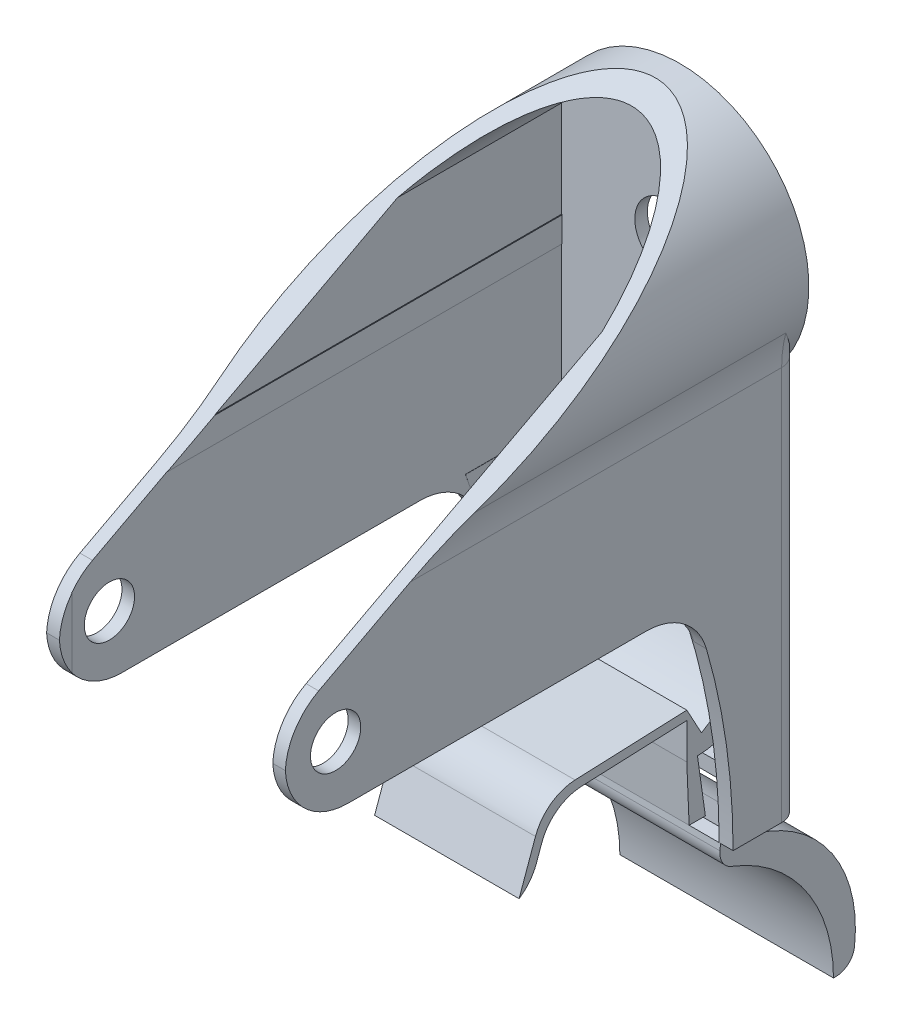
ISO-10303-21;
HEADER;
FILE_DESCRIPTION(('STEP AP214'),'2;1');
FILE_NAME('part.step','',(''),(''),'','','');
FILE_SCHEMA(('AUTOMOTIVE_DESIGN { 1 0 10303 214 1 1 1 1 }'));
ENDSEC;
DATA;
#1=APPLICATION_CONTEXT('core data for automotive mechanical design processes');
#2=APPLICATION_PROTOCOL_DEFINITION('international standard','automotive_design',2000,#1);
#3=PRODUCT_CONTEXT('',#1,'mechanical');
#4=PRODUCT('Part','Part','',(#3));
#5=PRODUCT_RELATED_PRODUCT_CATEGORY('part','',(#4));
#6=PRODUCT_DEFINITION_FORMATION('','',#4);
#7=PRODUCT_DEFINITION_CONTEXT('part definition',#1,'design');
#8=PRODUCT_DEFINITION('design','',#6,#7);
#9=PRODUCT_DEFINITION_SHAPE('','',#8);
#10=(LENGTH_UNIT() NAMED_UNIT(*) SI_UNIT(.MILLI.,.METRE.));
#11=(NAMED_UNIT(*) PLANE_ANGLE_UNIT() SI_UNIT($,.RADIAN.));
#12=(NAMED_UNIT(*) SI_UNIT($,.STERADIAN.) SOLID_ANGLE_UNIT());
#13=UNCERTAINTY_MEASURE_WITH_UNIT(LENGTH_MEASURE(1.E-05),#10,'distance_accuracy_value','');
#14=(GEOMETRIC_REPRESENTATION_CONTEXT(3) GLOBAL_UNCERTAINTY_ASSIGNED_CONTEXT((#13)) GLOBAL_UNIT_ASSIGNED_CONTEXT((#10,
#11,#12)) REPRESENTATION_CONTEXT('',''));
#15=CARTESIAN_POINT('',(0.,0.,0.));
#16=DIRECTION('',(0.,0.,1.));
#17=DIRECTION('',(1.,0.,0.));
#18=AXIS2_PLACEMENT_3D('',#15,#16,#17);
#19=CARTESIAN_POINT('',(8.09090108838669,-25.,0.0076987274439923));
#20=DIRECTION('',(0.,0.,-1.));
#21=DIRECTION('',(-1.,0.,0.));
#22=AXIS2_PLACEMENT_3D('',#19,#20,#21);
#23=PLANE('',#22);
#24=CARTESIAN_POINT('',(-11.0707271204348,8.38087947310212,0.00769872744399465));
#25=DIRECTION('',(0.,0.,-1.));
#26=DIRECTION('',(-1.,0.,0.));
#27=AXIS2_PLACEMENT_3D('',#24,#25,#26);
#28=CIRCLE('',#27,5.2);
#29=CARTESIAN_POINT('',(-16.2707271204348,8.38087947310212,0.00769872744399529));
#30=VERTEX_POINT('',#29);
#31=EDGE_CURVE('P0_E1256',#30,#30,#28,.T.);
#32=ORIENTED_EDGE('',*,*,#31,.F.);
#33=EDGE_LOOP('',(#32));
#34=FACE_BOUND('',#33,.T.);
#35=CARTESIAN_POINT('',(-11.0707271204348,10.8823274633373,0.00769872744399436));
#36=DIRECTION('',(0.,0.,-1.));
#37=DIRECTION('',(-1.,0.,0.));
#38=AXIS2_PLACEMENT_3D('',#35,#36,#37);
#39=CIRCLE('',#38,18.5);
#40=CARTESIAN_POINT('',(-29.5707271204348,10.8823274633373,0.00769872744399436));
#41=VERTEX_POINT('',#40);
#42=EDGE_CURVE('P0_E290',#41,#41,#39,.T.);
#43=ORIENTED_EDGE('',*,*,#42,.T.);
#44=EDGE_LOOP('',(#43));
#45=FACE_BOUND('',#44,.T.);
#46=ADVANCED_FACE('P0_F34',(#34,#45),#23,.T.);
#47=CARTESIAN_POINT('',(-27.9090989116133,-89.7153873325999,-10.1373393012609));
#48=DIRECTION('',(0.,-1.,0.));
#49=DIRECTION('',(0.,0.,-1.));
#50=AXIS2_PLACEMENT_3D('',#47,#48,#49);
#51=PLANE('',#50);
#52=DIRECTION('',(0.,0.,-1.));
#53=VECTOR('',#52,1.);
#54=CARTESIAN_POINT('',(6.09090108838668,-89.7153873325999,-10.1373393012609));
#55=LINE('',#54,#53);
#56=CARTESIAN_POINT('',(6.09090108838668,-89.7153873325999,-7.62485036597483));
#57=VERTEX_POINT('',#56);
#58=CARTESIAN_POINT('',(6.09090108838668,-89.7153873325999,-7.25285879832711));
#59=VERTEX_POINT('',#58);
#60=EDGE_CURVE('P0_E338',#57,#59,#55,.F.);
#61=ORIENTED_EDGE('',*,*,#60,.T.);
#62=DIRECTION('',(1.,0.,0.));
#63=VECTOR('',#62,1.);
#64=CARTESIAN_POINT('',(-27.9090989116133,-89.7153873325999,-7.25285879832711));
#65=LINE('',#64,#63);
#66=CARTESIAN_POINT('',(-27.9090989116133,-89.7153873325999,-7.25285879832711));
#67=VERTEX_POINT('',#66);
#68=EDGE_CURVE('P0_E289',#59,#67,#65,.F.);
#69=ORIENTED_EDGE('',*,*,#68,.T.);
#70=DIRECTION('',(0.,0.,-1.));
#71=VECTOR('',#70,1.);
#72=CARTESIAN_POINT('',(-27.9090989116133,-89.7153873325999,-10.1373393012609));
#73=LINE('',#72,#71);
#74=CARTESIAN_POINT('',(-27.9090989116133,-89.7153873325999,-7.62485036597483));
#75=VERTEX_POINT('',#74);
#76=EDGE_CURVE('P0_E341',#67,#75,#73,.T.);
#77=ORIENTED_EDGE('',*,*,#76,.T.);
#78=DIRECTION('',(1.,0.,0.));
#79=VECTOR('',#78,1.);
#80=CARTESIAN_POINT('',(-27.9090989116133,-89.7153873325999,-7.62485036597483));
#81=LINE('',#80,#79);
#82=EDGE_CURVE('P0_E1058',#57,#75,#81,.F.);
#83=ORIENTED_EDGE('',*,*,#82,.F.);
#84=EDGE_LOOP('',(#61,#69,#77,#83));
#85=FACE_BOUND('',#84,.T.);
#86=ADVANCED_FACE('P0_F774',(#85),#51,.T.);
#87=CARTESIAN_POINT('',(-11.0707271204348,10.8823274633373,82.));
#88=DIRECTION('',(0.,0.,-1.));
#89=DIRECTION('',(-1.,0.,0.));
#90=AXIS2_PLACEMENT_3D('',#87,#88,#89);
#91=CYLINDRICAL_SURFACE('',#90,18.5);
#92=CARTESIAN_POINT('',(-11.0707271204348,10.8823274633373,0.));
#93=DIRECTION('',(0.,0.,-1.));
#94=DIRECTION('',(-1.,0.,0.));
#95=AXIS2_PLACEMENT_3D('',#92,#93,#94);
#96=CIRCLE('',#95,18.5);
#97=CARTESIAN_POINT('',(-29.5707271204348,10.8823274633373,0.));
#98=VERTEX_POINT('',#97);
#99=EDGE_CURVE('P0_E321',#98,#98,#96,.T.);
#100=ORIENTED_EDGE('',*,*,#99,.T.);
#101=EDGE_LOOP('',(#100));
#102=FACE_BOUND('',#101,.T.);
#103=ORIENTED_EDGE('',*,*,#42,.F.);
#104=EDGE_LOOP('',(#103));
#105=FACE_BOUND('',#104,.T.);
#106=ADVANCED_FACE('P0_F772',(#102,#105),#91,.F.);
#107=CARTESIAN_POINT('',(-29.9090989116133,-25.,17.3374158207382));
#108=DIRECTION('',(0.,-0.99999927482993,-0.00120430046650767));
#109=DIRECTION('',(0.,0.00120430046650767,-0.99999927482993));
#110=AXIS2_PLACEMENT_3D('',#107,#108,#109);
#111=PLANE('',#110);
#112=CARTESIAN_POINT('',(-26.9090989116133,-24.9827334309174,3.));
#113=DIRECTION('',(0.,-0.99999927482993,-0.00120430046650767));
#114=DIRECTION('',(0.,0.00120430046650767,-0.99999927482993));
#115=AXIS2_PLACEMENT_3D('',#112,#113,#114);
#116=ELLIPSE('',#115,3.00000217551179,3.);
#117=CARTESIAN_POINT('',(-27.1238850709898,-24.9791297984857,0.00769872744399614));
#118=VERTEX_POINT('',#117);
#119=CARTESIAN_POINT('',(-26.9090989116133,-24.9791205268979,0.));
#120=VERTEX_POINT('',#119);
#121=EDGE_CURVE('P0_E277',#118,#120,#116,.T.);
#122=ORIENTED_EDGE('',*,*,#121,.F.);
#123=DIRECTION('',(-1.,0.,0.));
#124=VECTOR('',#123,1.);
#125=CARTESIAN_POINT('',(8.09090108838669,-24.9791297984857,0.0076987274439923));
#126=LINE('',#125,#124);
#127=CARTESIAN_POINT('',(5.30568724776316,-24.9791297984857,0.00769872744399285));
#128=VERTEX_POINT('',#127);
#129=EDGE_CURVE('P0_E324',#128,#118,#126,.T.);
#130=ORIENTED_EDGE('',*,*,#129,.F.);
#131=CARTESIAN_POINT('',(5.09090108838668,-24.9827334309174,3.));
#132=DIRECTION('',(0.,-0.99999927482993,-0.00120430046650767));
#133=DIRECTION('',(0.,0.00120430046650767,-0.99999927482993));
#134=AXIS2_PLACEMENT_3D('',#131,#132,#133);
#135=ELLIPSE('',#134,3.00000217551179,3.);
#136=CARTESIAN_POINT('',(5.09090108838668,-24.9791205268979,0.));
#137=VERTEX_POINT('',#136);
#138=EDGE_CURVE('P0_E296',#137,#128,#135,.T.);
#139=ORIENTED_EDGE('',*,*,#138,.F.);
#140=DIRECTION('',(1.,0.,0.));
#141=VECTOR('',#140,1.);
#142=CARTESIAN_POINT('',(-29.9090989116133,-24.9791205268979,0.));
#143=LINE('',#142,#141);
#144=EDGE_CURVE('P0_E293',#137,#120,#143,.F.);
#145=ORIENTED_EDGE('',*,*,#144,.T.);
#146=EDGE_LOOP('',(#122,#130,#139,#145));
#147=FACE_BOUND('',#146,.T.);
#148=ADVANCED_FACE('P0_F294',(#147),#111,.F.);
#149=CARTESIAN_POINT('',(-27.9090989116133,-89.7153873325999,17.8719688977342));
#150=DIRECTION('',(1.,0.,0.));
#151=DIRECTION('',(0.,0.,-1.));
#152=AXIS2_PLACEMENT_3D('',#149,#150,#151);
#153=CYLINDRICAL_SURFACE('',#152,25.1248276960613);
#154=DIRECTION('',(1.,0.,0.));
#155=VECTOR('',#154,1.);
#156=CARTESIAN_POINT('',(-27.9090989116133,-66.2447274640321,8.90619552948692));
#157=LINE('',#156,#155);
#158=CARTESIAN_POINT('',(-27.9090989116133,-66.2447274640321,8.90619552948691));
#159=VERTEX_POINT('',#158);
#160=CARTESIAN_POINT('',(6.09090108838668,-66.2447274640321,8.90619552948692));
#161=VERTEX_POINT('',#160);
#162=EDGE_CURVE('P0_E1059',#159,#161,#157,.T.);
#163=ORIENTED_EDGE('',*,*,#162,.F.);
#164=CARTESIAN_POINT('',(-27.9090989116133,-89.7153873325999,17.8719688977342));
#165=DIRECTION('',(1.,0.,0.));
#166=DIRECTION('',(0.,0.,-1.));
#167=AXIS2_PLACEMENT_3D('',#164,#165,#166);
#168=CIRCLE('',#167,25.1248276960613);
#169=EDGE_CURVE('P0_E966',#67,#159,#168,.T.);
#170=ORIENTED_EDGE('',*,*,#169,.F.);
#171=ORIENTED_EDGE('',*,*,#68,.F.);
#172=CARTESIAN_POINT('',(6.09090108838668,-89.7153873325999,17.8719688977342));
#173=DIRECTION('',(1.,0.,0.));
#174=DIRECTION('',(0.,0.,-1.));
#175=AXIS2_PLACEMENT_3D('',#172,#173,#174);
#176=CIRCLE('',#175,25.1248276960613);
#177=EDGE_CURVE('P0_E590',#59,#161,#176,.T.);
#178=ORIENTED_EDGE('',*,*,#177,.T.);
#179=EDGE_LOOP('',(#163,#170,#171,#178));
#180=FACE_BOUND('',#179,.T.);
#181=ADVANCED_FACE('P0_F765',(#180),#153,.F.);
#182=CARTESIAN_POINT('',(-27.9090989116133,-63.4422413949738,7.83564808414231));
#183=DIRECTION('',(1.,0.,0.));
#184=DIRECTION('',(0.,0.,-1.));
#185=AXIS2_PLACEMENT_3D('',#182,#183,#184);
#186=CYLINDRICAL_SURFACE('',#185,3.);
#187=CARTESIAN_POINT('',(6.09090108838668,-63.4422413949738,7.83564808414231));
#188=DIRECTION('',(1.,0.,0.));
#189=DIRECTION('',(0.,0.,-1.));
#190=AXIS2_PLACEMENT_3D('',#187,#188,#189);
#191=CIRCLE('',#190,3.);
#192=CARTESIAN_POINT('',(6.09090108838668,-63.150537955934,10.8214325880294));
#193=VERTEX_POINT('',#192);
#194=EDGE_CURVE('P0_E575',#161,#193,#191,.F.);
#195=ORIENTED_EDGE('',*,*,#194,.T.);
#196=DIRECTION('',(1.,0.,0.));
#197=VECTOR('',#196,1.);
#198=CARTESIAN_POINT('',(-27.9090989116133,-63.150537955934,10.8214325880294));
#199=LINE('',#198,#197);
#200=CARTESIAN_POINT('',(-27.9090989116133,-63.150537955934,10.8214325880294));
#201=VERTEX_POINT('',#200);
#202=EDGE_CURVE('P0_E1038',#201,#193,#199,.T.);
#203=ORIENTED_EDGE('',*,*,#202,.F.);
#204=CARTESIAN_POINT('',(-27.9090989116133,-63.4422413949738,7.83564808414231));
#205=DIRECTION('',(1.,0.,0.));
#206=DIRECTION('',(0.,0.,-1.));
#207=AXIS2_PLACEMENT_3D('',#204,#205,#206);
#208=CIRCLE('',#207,3.);
#209=EDGE_CURVE('P0_E603',#159,#201,#208,.F.);
#210=ORIENTED_EDGE('',*,*,#209,.F.);
#211=ORIENTED_EDGE('',*,*,#162,.T.);
#212=EDGE_LOOP('',(#195,#203,#210,#211));
#213=FACE_BOUND('',#212,.T.);
#214=ADVANCED_FACE('P0_F761',(#213),#186,.T.);
#215=CARTESIAN_POINT('',(-27.9090989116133,-84.6142689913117,11.0542184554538));
#216=DIRECTION('',(1.,0.,0.));
#217=DIRECTION('',(0.,0.,-1.));
#218=AXIS2_PLACEMENT_3D('',#215,#216,#217);
#219=CYLINDRICAL_SURFACE('',#218,21.7968696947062);
#220=CARTESIAN_POINT('',(6.09090108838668,-84.6142689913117,11.0542184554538));
#221=DIRECTION('',(1.,0.,0.));
#222=DIRECTION('',(0.,0.,-1.));
#223=AXIS2_PLACEMENT_3D('',#220,#221,#222);
#224=CIRCLE('',#223,21.7968696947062);
#225=CARTESIAN_POINT('',(6.09090108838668,-64.3600572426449,3.));
#226=VERTEX_POINT('',#225);
#227=CARTESIAN_POINT('',(6.09090108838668,-87.0507280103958,-10.6060492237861));
#228=VERTEX_POINT('',#227);
#229=EDGE_CURVE('P0_E569',#226,#228,#224,.F.);
#230=ORIENTED_EDGE('',*,*,#229,.T.);
#231=DIRECTION('',(1.,0.,0.));
#232=VECTOR('',#231,1.);
#233=CARTESIAN_POINT('',(-27.9090989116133,-87.0507280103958,-10.6060492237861));
#234=LINE('',#233,#232);
#235=CARTESIAN_POINT('',(-27.9090989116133,-87.0507280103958,-10.6060492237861));
#236=VERTEX_POINT('',#235);
#237=EDGE_CURVE('P0_E1056',#236,#228,#234,.T.);
#238=ORIENTED_EDGE('',*,*,#237,.F.);
#239=CARTESIAN_POINT('',(-27.9090989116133,-84.6142689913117,11.0542184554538));
#240=DIRECTION('',(1.,0.,0.));
#241=DIRECTION('',(0.,0.,-1.));
#242=AXIS2_PLACEMENT_3D('',#239,#240,#241);
#243=CIRCLE('',#242,21.7968696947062);
#244=CARTESIAN_POINT('',(-27.9090989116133,-64.3600572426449,3.));
#245=VERTEX_POINT('',#244);
#246=EDGE_CURVE('P0_E597',#245,#236,#243,.F.);
#247=ORIENTED_EDGE('',*,*,#246,.F.);
#248=DIRECTION('',(1.,0.,0.));
#249=VECTOR('',#248,1.);
#250=CARTESIAN_POINT('',(-27.9090989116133,-64.3600572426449,3.));
#251=LINE('',#250,#249);
#252=EDGE_CURVE('P0_E1053',#226,#245,#251,.F.);
#253=ORIENTED_EDGE('',*,*,#252,.F.);
#254=EDGE_LOOP('',(#230,#238,#247,#253));
#255=FACE_BOUND('',#254,.T.);
#256=ADVANCED_FACE('P0_F757',(#255),#219,.T.);
#257=CARTESIAN_POINT('',(-27.9090989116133,-86.7153873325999,-7.62485036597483));
#258=DIRECTION('',(1.,0.,0.));
#259=DIRECTION('',(0.,0.,-1.));
#260=AXIS2_PLACEMENT_3D('',#257,#258,#259);
#261=CYLINDRICAL_SURFACE('',#260,3.);
#262=CARTESIAN_POINT('',(6.09090108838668,-86.7153873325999,-7.62485036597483));
#263=DIRECTION('',(1.,0.,0.));
#264=DIRECTION('',(0.,0.,-1.));
#265=AXIS2_PLACEMENT_3D('',#262,#263,#264);
#266=CIRCLE('',#265,3.);
#267=EDGE_CURVE('P0_E563',#228,#57,#266,.F.);
#268=ORIENTED_EDGE('',*,*,#267,.T.);
#269=ORIENTED_EDGE('',*,*,#82,.T.);
#270=CARTESIAN_POINT('',(-27.9090989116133,-86.7153873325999,-7.62485036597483));
#271=DIRECTION('',(1.,0.,0.));
#272=DIRECTION('',(0.,0.,-1.));
#273=AXIS2_PLACEMENT_3D('',#270,#271,#272);
#274=CIRCLE('',#273,3.);
#275=EDGE_CURVE('P0_E314',#236,#75,#274,.F.);
#276=ORIENTED_EDGE('',*,*,#275,.F.);
#277=ORIENTED_EDGE('',*,*,#237,.T.);
#278=EDGE_LOOP('',(#268,#269,#276,#277));
#279=FACE_BOUND('',#278,.T.);
#280=ADVANCED_FACE('P0_F753',(#279),#261,.T.);
#281=CARTESIAN_POINT('',(-27.9090989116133,-62.1722136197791,8.501843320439));
#282=DIRECTION('',(0.,0.929225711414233,-0.369512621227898));
#283=DIRECTION('',(0.,0.369512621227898,0.929225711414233));
#284=AXIS2_PLACEMENT_3D('',#281,#282,#283);
#285=PLANE('',#284);
#286=DIRECTION('',(1.,0.,0.));
#287=VECTOR('',#286,1.);
#288=CARTESIAN_POINT('',(-27.9090989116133,-62.1722136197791,8.501843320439));
#289=LINE('',#288,#287);
#290=CARTESIAN_POINT('',(5.86918831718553,-62.1722136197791,8.501843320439));
#291=VERTEX_POINT('',#290);
#292=CARTESIAN_POINT('',(-27.8783215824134,-62.1722136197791,8.501843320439));
#293=VERTEX_POINT('',#292);
#294=EDGE_CURVE('P0_E560',#291,#293,#289,.F.);
#295=ORIENTED_EDGE('',*,*,#294,.F.);
#296=DIRECTION('',(1.,0.,0.));
#297=VECTOR('',#296,1.);
#298=CARTESIAN_POINT('',(-27.9090989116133,-62.1722136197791,8.501843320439));
#299=LINE('',#298,#297);
#300=CARTESIAN_POINT('',(6.09090108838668,-62.1722136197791,8.501843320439));
#301=VERTEX_POINT('',#300);
#302=EDGE_CURVE('P0_E1045',#291,#301,#299,.T.);
#303=ORIENTED_EDGE('',*,*,#302,.T.);
#304=DIRECTION('',(0.,-0.369512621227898,-0.929225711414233));
#305=VECTOR('',#304,1.);
#306=CARTESIAN_POINT('',(6.09090108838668,-62.1722136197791,8.501843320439));
#307=LINE('',#306,#305);
#308=EDGE_CURVE('P0_E566',#301,#226,#307,.T.);
#309=ORIENTED_EDGE('',*,*,#308,.T.);
#310=ORIENTED_EDGE('',*,*,#252,.T.);
#311=DIRECTION('',(0.,-0.369512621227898,-0.929225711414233));
#312=VECTOR('',#311,1.);
#313=CARTESIAN_POINT('',(-27.9090989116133,-62.1722136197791,8.501843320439));
#314=LINE('',#313,#312);
#315=CARTESIAN_POINT('',(-27.9090989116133,-62.1722136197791,8.501843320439));
#316=VERTEX_POINT('',#315);
#317=EDGE_CURVE('P0_E594',#316,#245,#314,.T.);
#318=ORIENTED_EDGE('',*,*,#317,.F.);
#319=DIRECTION('',(1.,0.,0.));
#320=VECTOR('',#319,1.);
#321=CARTESIAN_POINT('',(-27.9090989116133,-62.1722136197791,8.501843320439));
#322=LINE('',#321,#320);
#323=EDGE_CURVE('P0_E1048',#316,#293,#322,.T.);
#324=ORIENTED_EDGE('',*,*,#323,.T.);
#325=EDGE_LOOP('',(#295,#303,#309,#310,#318,#324));
#326=FACE_BOUND('',#325,.T.);
#327=ADVANCED_FACE('P0_F749',(#326),#285,.T.);
#328=CARTESIAN_POINT('',(-27.9090989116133,-65.5332607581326,11.0542184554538));
#329=DIRECTION('',(0.,0.0972344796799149,0.995261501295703));
#330=DIRECTION('',(0.,-0.995261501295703,0.0972344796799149));
#331=AXIS2_PLACEMENT_3D('',#328,#329,#330);
#332=PLANE('',#331);
#333=DIRECTION('',(1.,0.,0.));
#334=VECTOR('',#333,1.);
#335=CARTESIAN_POINT('',(-27.9090989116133,-62.1722136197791,10.7258528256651));
#336=LINE('',#335,#334);
#337=CARTESIAN_POINT('',(-27.8783215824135,-62.1722136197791,10.7258528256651));
#338=VERTEX_POINT('',#337);
#339=CARTESIAN_POINT('',(5.86918831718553,-62.1722136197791,10.7258528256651));
#340=VERTEX_POINT('',#339);
#341=EDGE_CURVE('P0_E544',#338,#340,#336,.T.);
#342=ORIENTED_EDGE('',*,*,#341,.F.);
#343=DIRECTION('',(1.,0.,0.));
#344=VECTOR('',#343,1.);
#345=CARTESIAN_POINT('',(-29.9090989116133,-62.1722136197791,10.7258528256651));
#346=LINE('',#345,#344);
#347=CARTESIAN_POINT('',(-27.9090989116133,-62.1722136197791,10.7258528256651));
#348=VERTEX_POINT('',#347);
#349=EDGE_CURVE('P0_E971',#338,#348,#346,.F.);
#350=ORIENTED_EDGE('',*,*,#349,.T.);
#351=DIRECTION('',(0.,0.995261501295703,-0.0972344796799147));
#352=VECTOR('',#351,1.);
#353=CARTESIAN_POINT('',(-27.9090989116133,-63.150537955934,10.8214325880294));
#354=LINE('',#353,#352);
#355=EDGE_CURVE('P0_E598',#201,#348,#354,.T.);
#356=ORIENTED_EDGE('',*,*,#355,.F.);
#357=ORIENTED_EDGE('',*,*,#202,.T.);
#358=DIRECTION('',(0.,0.995261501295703,-0.0972344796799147));
#359=VECTOR('',#358,1.);
#360=CARTESIAN_POINT('',(6.09090108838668,-63.150537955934,10.8214325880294));
#361=LINE('',#360,#359);
#362=CARTESIAN_POINT('',(6.09090108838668,-62.1722136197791,10.7258528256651));
#363=VERTEX_POINT('',#362);
#364=EDGE_CURVE('P0_E570',#193,#363,#361,.T.);
#365=ORIENTED_EDGE('',*,*,#364,.T.);
#366=DIRECTION('',(1.,0.,0.));
#367=VECTOR('',#366,1.);
#368=CARTESIAN_POINT('',(-27.9090989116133,-62.1722136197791,10.7258528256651));
#369=LINE('',#368,#367);
#370=EDGE_CURVE('P0_E1036',#363,#340,#369,.F.);
#371=ORIENTED_EDGE('',*,*,#370,.T.);
#372=EDGE_LOOP('',(#342,#350,#356,#357,#365,#371));
#373=FACE_BOUND('',#372,.T.);
#374=ADVANCED_FACE('P0_F745',(#373),#332,.T.);
#375=CARTESIAN_POINT('',(-23.0595860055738,-59.8815833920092,4.));
#376=DIRECTION('',(-1.,0.,0.));
#377=DIRECTION('',(0.,0.,1.));
#378=AXIS2_PLACEMENT_3D('',#375,#376,#377);
#379=PLANE('',#378);
#380=DIRECTION('',(0.,1.,0.));
#381=VECTOR('',#380,1.);
#382=CARTESIAN_POINT('',(-23.0595860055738,-24.9791205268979,0.));
#383=LINE('',#382,#381);
#384=CARTESIAN_POINT('',(-23.0595860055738,-59.8815833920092,0.));
#385=VERTEX_POINT('',#384);
#386=CARTESIAN_POINT('',(-23.0595860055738,-43.1228895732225,0.));
#387=VERTEX_POINT('',#386);
#388=EDGE_CURVE('P0_E317',#385,#387,#383,.T.);
#389=ORIENTED_EDGE('',*,*,#388,.T.);
#390=DIRECTION('',(0.,0.,1.));
#391=VECTOR('',#390,1.);
#392=CARTESIAN_POINT('',(-23.0595860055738,-43.1228895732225,4.));
#393=LINE('',#392,#391);
#394=CARTESIAN_POINT('',(-23.0595860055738,-43.1228895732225,1.95605946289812));
#395=VERTEX_POINT('',#394);
#396=EDGE_CURVE('P0_E1015',#387,#395,#393,.T.);
#397=ORIENTED_EDGE('',*,*,#396,.T.);
#398=DIRECTION('',(0.,1.,0.));
#399=VECTOR('',#398,1.);
#400=CARTESIAN_POINT('',(-23.0595860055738,-24.1722136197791,1.95605946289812));
#401=LINE('',#400,#399);
#402=CARTESIAN_POINT('',(-23.0595860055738,-59.8815833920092,1.95605946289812));
#403=VERTEX_POINT('',#402);
#404=EDGE_CURVE('P0_E541',#395,#403,#401,.F.);
#405=ORIENTED_EDGE('',*,*,#404,.T.);
#406=DIRECTION('',(0.,0.,-1.));
#407=VECTOR('',#406,1.);
#408=CARTESIAN_POINT('',(-23.0595860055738,-59.8815833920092,4.));
#409=LINE('',#408,#407);
#410=EDGE_CURVE('P0_E1033',#403,#385,#409,.T.);
#411=ORIENTED_EDGE('',*,*,#410,.T.);
#412=EDGE_LOOP('',(#389,#397,#405,#411));
#413=FACE_BOUND('',#412,.T.);
#414=ADVANCED_FACE('P0_F741',(#413),#379,.F.);
#415=CARTESIAN_POINT('',(1.82062866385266,-59.8815833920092,4.));
#416=DIRECTION('',(0.,-1.,0.));
#417=DIRECTION('',(0.,0.,-1.));
#418=AXIS2_PLACEMENT_3D('',#415,#416,#417);
#419=PLANE('',#418);
#420=DIRECTION('',(1.,0.,0.));
#421=VECTOR('',#420,1.);
#422=CARTESIAN_POINT('',(-29.9090989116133,-59.8815833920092,0.));
#423=LINE('',#422,#421);
#424=CARTESIAN_POINT('',(1.82062866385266,-59.8815833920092,0.));
#425=VERTEX_POINT('',#424);
#426=EDGE_CURVE('P0_E620',#425,#385,#423,.F.);
#427=ORIENTED_EDGE('',*,*,#426,.T.);
#428=ORIENTED_EDGE('',*,*,#410,.F.);
#429=DIRECTION('',(-1.,0.,0.));
#430=VECTOR('',#429,1.);
#431=CARTESIAN_POINT('',(5.86918831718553,-59.8815833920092,1.95605946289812));
#432=LINE('',#431,#430);
#433=CARTESIAN_POINT('',(1.82062866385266,-59.8815833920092,1.95605946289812));
#434=VERTEX_POINT('',#433);
#435=EDGE_CURVE('P0_E538',#403,#434,#432,.F.);
#436=ORIENTED_EDGE('',*,*,#435,.T.);
#437=DIRECTION('',(0.,0.,-1.));
#438=VECTOR('',#437,1.);
#439=CARTESIAN_POINT('',(1.82062866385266,-59.8815833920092,4.));
#440=LINE('',#439,#438);
#441=EDGE_CURVE('P0_E1030',#434,#425,#440,.T.);
#442=ORIENTED_EDGE('',*,*,#441,.T.);
#443=EDGE_LOOP('',(#427,#428,#436,#442));
#444=FACE_BOUND('',#443,.T.);
#445=ADVANCED_FACE('P0_F737',(#444),#419,.F.);
#446=CARTESIAN_POINT('',(1.82062866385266,-59.8815833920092,4.));
#447=DIRECTION('',(1.,0.,0.));
#448=DIRECTION('',(0.,0.,-1.));
#449=AXIS2_PLACEMENT_3D('',#446,#447,#448);
#450=PLANE('',#449);
#451=DIRECTION('',(0.,1.,0.));
#452=VECTOR('',#451,1.);
#453=CARTESIAN_POINT('',(1.82062866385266,-24.9791205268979,0.));
#454=LINE('',#453,#452);
#455=CARTESIAN_POINT('',(1.82062866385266,-43.1228895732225,0.));
#456=VERTEX_POINT('',#455);
#457=EDGE_CURVE('P0_E623',#456,#425,#454,.F.);
#458=ORIENTED_EDGE('',*,*,#457,.T.);
#459=ORIENTED_EDGE('',*,*,#441,.F.);
#460=DIRECTION('',(0.,1.,0.));
#461=VECTOR('',#460,1.);
#462=CARTESIAN_POINT('',(1.82062866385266,-24.1722136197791,1.95605946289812));
#463=LINE('',#462,#461);
#464=CARTESIAN_POINT('',(1.82062866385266,-43.1228895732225,1.95605946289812));
#465=VERTEX_POINT('',#464);
#466=EDGE_CURVE('P0_E535',#434,#465,#463,.T.);
#467=ORIENTED_EDGE('',*,*,#466,.T.);
#468=DIRECTION('',(0.,0.,1.));
#469=VECTOR('',#468,1.);
#470=CARTESIAN_POINT('',(1.82062866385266,-43.1228895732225,4.));
#471=LINE('',#470,#469);
#472=EDGE_CURVE('P0_E1027',#465,#456,#471,.F.);
#473=ORIENTED_EDGE('',*,*,#472,.T.);
#474=EDGE_LOOP('',(#458,#459,#467,#473));
#475=FACE_BOUND('',#474,.T.);
#476=ADVANCED_FACE('P0_F733',(#475),#450,.F.);
#477=CARTESIAN_POINT('',(1.82062866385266,-43.1228895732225,4.));
#478=DIRECTION('',(0.,1.,0.));
#479=DIRECTION('',(0.,0.,1.));
#480=AXIS2_PLACEMENT_3D('',#477,#478,#479);
#481=PLANE('',#480);
#482=DIRECTION('',(1.,0.,0.));
#483=VECTOR('',#482,1.);
#484=CARTESIAN_POINT('',(-29.9090989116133,-43.1228895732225,0.));
#485=LINE('',#484,#483);
#486=EDGE_CURVE('P0_E626',#387,#456,#485,.T.);
#487=ORIENTED_EDGE('',*,*,#486,.T.);
#488=ORIENTED_EDGE('',*,*,#472,.F.);
#489=DIRECTION('',(-1.,0.,0.));
#490=VECTOR('',#489,1.);
#491=CARTESIAN_POINT('',(5.86918831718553,-43.1228895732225,1.95605946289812));
#492=LINE('',#491,#490);
#493=EDGE_CURVE('P0_E532',#465,#395,#492,.T.);
#494=ORIENTED_EDGE('',*,*,#493,.T.);
#495=ORIENTED_EDGE('',*,*,#396,.F.);
#496=EDGE_LOOP('',(#487,#488,#494,#495));
#497=FACE_BOUND('',#496,.T.);
#498=ADVANCED_FACE('P0_F729',(#497),#481,.F.);
#499=CARTESIAN_POINT('',(-27.866019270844,17.,2.00769872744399));
#500=DIRECTION('',(-1.,0.,0.));
#501=DIRECTION('',(0.,0.,1.));
#502=AXIS2_PLACEMENT_3D('',#499,#500,#501);
#503=PLANE('',#502);
#504=CARTESIAN_POINT('',(-27.866019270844,-16.0042408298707,72.007698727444));
#505=DIRECTION('',(1.,0.,0.));
#506=DIRECTION('',(0.,0.,-1.));
#507=AXIS2_PLACEMENT_3D('',#504,#505,#506);
#508=CIRCLE('',#507,10.);
#509=CARTESIAN_POINT('',(-27.866019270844,-15.5021204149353,81.9950845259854));
#510=VERTEX_POINT('',#509);
#511=CARTESIAN_POINT('',(-27.866019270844,-10.0042408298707,80.007698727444));
#512=VERTEX_POINT('',#511);
#513=EDGE_CURVE('P0_E941',#510,#512,#508,.F.);
#514=ORIENTED_EDGE('',*,*,#513,.F.);
#515=CARTESIAN_POINT('',(-27.866019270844,-15.,72.007698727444));
#516=DIRECTION('',(1.,0.,0.));
#517=DIRECTION('',(0.,0.,-1.));
#518=AXIS2_PLACEMENT_3D('',#515,#516,#517);
#519=CIRCLE('',#518,10.);
#520=CARTESIAN_POINT('',(-27.866019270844,-21.,80.007698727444));
#521=VERTEX_POINT('',#520);
#522=EDGE_CURVE('P0_E334',#521,#510,#519,.F.);
#523=ORIENTED_EDGE('',*,*,#522,.F.);
#524=DIRECTION('',(0.,1.,0.));
#525=VECTOR('',#524,1.);
#526=CARTESIAN_POINT('',(-27.866019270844,-25.,80.007698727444));
#527=LINE('',#526,#525);
#528=EDGE_CURVE('P0_E1012',#521,#512,#527,.T.);
#529=ORIENTED_EDGE('',*,*,#528,.T.);
#530=EDGE_LOOP('',(#514,#523,#529));
#531=FACE_BOUND('',#530,.T.);
#532=ADVANCED_FACE('P0_F725',(#531),#503,.F.);
#533=CARTESIAN_POINT('',(12.0909010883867,-15.5021204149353,73.9950845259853));
#534=DIRECTION('',(-1.,0.,0.));
#535=DIRECTION('',(0.,0.,1.));
#536=AXIS2_PLACEMENT_3D('',#533,#534,#535);
#537=CYLINDRICAL_SURFACE('',#536,4.);
#538=CARTESIAN_POINT('',(-27.9090989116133,-15.5021204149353,73.9950845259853));
#539=DIRECTION('',(-1.,0.,0.));
#540=DIRECTION('',(0.,0.,1.));
#541=AXIS2_PLACEMENT_3D('',#538,#539,#540);
#542=CIRCLE('',#541,4.);
#543=CARTESIAN_POINT('',(-27.9090989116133,-15.5021204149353,77.9950845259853));
#544=VERTEX_POINT('',#543);
#545=EDGE_CURVE('P0_E937',#544,#544,#542,.F.);
#546=ORIENTED_EDGE('',*,*,#545,.T.);
#547=EDGE_LOOP('',(#546));
#548=FACE_BOUND('',#547,.T.);
#549=CARTESIAN_POINT('',(-29.9090989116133,-15.5021204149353,73.9950845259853));
#550=DIRECTION('',(-1.,0.,0.));
#551=DIRECTION('',(0.,0.,1.));
#552=AXIS2_PLACEMENT_3D('',#549,#550,#551);
#553=CIRCLE('',#552,4.);
#554=CARTESIAN_POINT('',(-29.9090989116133,-15.5021204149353,77.9950845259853));
#555=VERTEX_POINT('',#554);
#556=EDGE_CURVE('P0_E947',#555,#555,#553,.F.);
#557=ORIENTED_EDGE('',*,*,#556,.F.);
#558=EDGE_LOOP('',(#557));
#559=FACE_BOUND('',#558,.T.);
#560=ADVANCED_FACE('P0_F721',(#548,#559),#537,.F.);
#561=CARTESIAN_POINT('',(-29.9090989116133,-35.,24.5762377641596));
#562=DIRECTION('',(1.,0.,0.));
#563=DIRECTION('',(0.,0.,-1.));
#564=AXIS2_PLACEMENT_3D('',#561,#562,#563);
#565=CYLINDRICAL_SURFACE('',#564,10.);
#566=DIRECTION('',(1.,0.,0.));
#567=VECTOR('',#566,1.);
#568=CARTESIAN_POINT('',(-29.9090989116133,-32.2217264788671,14.9699275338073));
#569=LINE('',#568,#567);
#570=CARTESIAN_POINT('',(-29.9090989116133,-32.2217264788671,14.9699275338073));
#571=VERTEX_POINT('',#570);
#572=CARTESIAN_POINT('',(-27.9090989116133,-32.2217264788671,14.9699275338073));
#573=VERTEX_POINT('',#572);
#574=EDGE_CURVE('P0_E307',#571,#573,#569,.T.);
#575=ORIENTED_EDGE('',*,*,#574,.T.);
#576=CARTESIAN_POINT('',(-27.9090989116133,-35.,24.5762377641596));
#577=DIRECTION('',(1.,0.,0.));
#578=DIRECTION('',(0.,0.,-1.));
#579=AXIS2_PLACEMENT_3D('',#576,#577,#578);
#580=CIRCLE('',#579,10.);
#581=CARTESIAN_POINT('',(-27.9090989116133,-25.,24.5762377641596));
#582=VERTEX_POINT('',#581);
#583=EDGE_CURVE('P0_E496',#573,#582,#580,.T.);
#584=ORIENTED_EDGE('',*,*,#583,.T.);
#585=DIRECTION('',(1.,0.,0.));
#586=VECTOR('',#585,1.);
#587=CARTESIAN_POINT('',(0.,-25.,24.5762377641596));
#588=LINE('',#587,#586);
#589=CARTESIAN_POINT('',(-29.9090989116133,-25.,24.5762377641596));
#590=VERTEX_POINT('',#589);
#591=EDGE_CURVE('P0_E1014',#590,#582,#588,.T.);
#592=ORIENTED_EDGE('',*,*,#591,.F.);
#593=CARTESIAN_POINT('',(-29.9090989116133,-35.,24.5762377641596));
#594=DIRECTION('',(1.,0.,0.));
#595=DIRECTION('',(0.,0.,-1.));
#596=AXIS2_PLACEMENT_3D('',#593,#594,#595);
#597=CIRCLE('',#596,10.);
#598=EDGE_CURVE('P0_E509',#571,#590,#597,.T.);
#599=ORIENTED_EDGE('',*,*,#598,.F.);
#600=EDGE_LOOP('',(#575,#584,#592,#599));
#601=FACE_BOUND('',#600,.T.);
#602=ADVANCED_FACE('P0_F717',(#601),#565,.F.);
#603=CARTESIAN_POINT('',(0.,-25.,0.));
#604=DIRECTION('',(0.,-1.,0.));
#605=DIRECTION('',(0.,0.,-1.));
#606=AXIS2_PLACEMENT_3D('',#603,#604,#605);
#607=PLANE('',#606);
#608=DIRECTION('',(0.,0.,1.));
#609=VECTOR('',#608,1.);
#610=CARTESIAN_POINT('',(-27.9090989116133,-25.,2.007698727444));
#611=LINE('',#610,#609);
#612=CARTESIAN_POINT('',(-27.9090989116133,-25.,72.007698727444));
#613=VERTEX_POINT('',#612);
#614=EDGE_CURVE('P0_E493',#582,#613,#611,.T.);
#615=ORIENTED_EDGE('',*,*,#614,.T.);
#616=DIRECTION('',(1.,0.,0.));
#617=VECTOR('',#616,1.);
#618=CARTESIAN_POINT('',(8.09090108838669,-25.,72.007698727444));
#619=LINE('',#618,#617);
#620=CARTESIAN_POINT('',(-29.9090989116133,-25.,72.007698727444));
#621=VERTEX_POINT('',#620);
#622=EDGE_CURVE('P0_E336',#621,#613,#619,.T.);
#623=ORIENTED_EDGE('',*,*,#622,.F.);
#624=DIRECTION('',(0.,0.,1.));
#625=VECTOR('',#624,1.);
#626=CARTESIAN_POINT('',(-29.9090989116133,-25.,0.00769872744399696));
#627=LINE('',#626,#625);
#628=EDGE_CURVE('P0_E506',#590,#621,#627,.T.);
#629=ORIENTED_EDGE('',*,*,#628,.F.);
#630=ORIENTED_EDGE('',*,*,#591,.T.);
#631=EDGE_LOOP('',(#615,#623,#629,#630));
#632=FACE_BOUND('',#631,.T.);
#633=ADVANCED_FACE('P0_F713',(#632),#607,.T.);
#634=CARTESIAN_POINT('',(8.09090108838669,-15.,72.007698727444));
#635=DIRECTION('',(1.,0.,0.));
#636=DIRECTION('',(0.,0.,-1.));
#637=AXIS2_PLACEMENT_3D('',#634,#635,#636);
#638=CYLINDRICAL_SURFACE('',#637,10.);
#639=DIRECTION('',(1.,0.,0.));
#640=VECTOR('',#639,1.);
#641=CARTESIAN_POINT('',(6.09090108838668,-21.,80.007698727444));
#642=LINE('',#641,#640);
#643=CARTESIAN_POINT('',(-27.9090989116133,-21.,80.007698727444));
#644=VERTEX_POINT('',#643);
#645=EDGE_CURVE('P0_E335',#644,#521,#642,.T.);
#646=ORIENTED_EDGE('',*,*,#645,.T.);
#647=ORIENTED_EDGE('',*,*,#522,.T.);
#648=DIRECTION('',(1.,0.,0.));
#649=VECTOR('',#648,1.);
#650=CARTESIAN_POINT('',(-71.9090989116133,-15.5021204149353,81.9950845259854));
#651=LINE('',#650,#649);
#652=CARTESIAN_POINT('',(-29.9090989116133,-15.5021204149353,81.9950845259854));
#653=VERTEX_POINT('',#652);
#654=EDGE_CURVE('P0_E943',#653,#510,#651,.T.);
#655=ORIENTED_EDGE('',*,*,#654,.F.);
#656=CARTESIAN_POINT('',(-29.9090989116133,-15.,72.007698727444));
#657=DIRECTION('',(1.,0.,0.));
#658=DIRECTION('',(0.,0.,-1.));
#659=AXIS2_PLACEMENT_3D('',#656,#657,#658);
#660=CIRCLE('',#659,10.);
#661=EDGE_CURVE('P0_E508',#621,#653,#660,.F.);
#662=ORIENTED_EDGE('',*,*,#661,.F.);
#663=ORIENTED_EDGE('',*,*,#622,.T.);
#664=CARTESIAN_POINT('',(-27.9090989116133,-15.,72.007698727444));
#665=DIRECTION('',(1.,0.,0.));
#666=DIRECTION('',(0.,0.,-1.));
#667=AXIS2_PLACEMENT_3D('',#664,#665,#666);
#668=CIRCLE('',#667,10.);
#669=EDGE_CURVE('P0_E492',#613,#644,#668,.F.);
#670=ORIENTED_EDGE('',*,*,#669,.T.);
#671=EDGE_LOOP('',(#646,#647,#655,#662,#663,#670));
#672=FACE_BOUND('',#671,.T.);
#673=ADVANCED_FACE('P0_F709',(#672),#638,.T.);
#674=CARTESIAN_POINT('',(6.09090108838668,-25.,80.007698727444));
#675=DIRECTION('',(0.,0.,1.));
#676=DIRECTION('',(1.,0.,0.));
#677=AXIS2_PLACEMENT_3D('',#674,#675,#676);
#678=PLANE('',#677);
#679=DIRECTION('',(1.,0.,0.));
#680=VECTOR('',#679,1.);
#681=CARTESIAN_POINT('',(-71.9090989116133,-10.0042408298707,80.007698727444));
#682=LINE('',#681,#680);
#683=CARTESIAN_POINT('',(-27.9090989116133,-10.0042408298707,80.007698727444));
#684=VERTEX_POINT('',#683);
#685=EDGE_CURVE('P0_E940',#512,#684,#682,.F.);
#686=ORIENTED_EDGE('',*,*,#685,.F.);
#687=ORIENTED_EDGE('',*,*,#528,.F.);
#688=ORIENTED_EDGE('',*,*,#645,.F.);
#689=DIRECTION('',(0.,1.,0.));
#690=VECTOR('',#689,1.);
#691=CARTESIAN_POINT('',(-27.9090989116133,-25.,80.007698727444));
#692=LINE('',#691,#690);
#693=EDGE_CURVE('P0_E488',#644,#684,#692,.T.);
#694=ORIENTED_EDGE('',*,*,#693,.T.);
#695=EDGE_LOOP('',(#686,#687,#688,#694));
#696=FACE_BOUND('',#695,.T.);
#697=ADVANCED_FACE('P0_F705',(#696),#678,.F.);
#698=CARTESIAN_POINT('',(-29.9090989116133,-25.,17.3374158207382));
#699=DIRECTION('',(0.,-0.99999927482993,-0.00120430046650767));
#700=DIRECTION('',(0.,0.00120430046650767,-0.99999927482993));
#701=AXIS2_PLACEMENT_3D('',#698,#699,#700);
#702=PLANE('',#701);
#703=DIRECTION('',(0.,0.00120430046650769,-0.99999927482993));
#704=VECTOR('',#703,1.);
#705=CARTESIAN_POINT('',(-27.8783215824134,-25.,17.3374158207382));
#706=LINE('',#705,#704);
#707=CARTESIAN_POINT('',(-27.8783215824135,-25.,17.3374158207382));
#708=VERTEX_POINT('',#707);
#709=CARTESIAN_POINT('',(-27.8783215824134,-24.9815384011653,2.00769872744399));
#710=VERTEX_POINT('',#709);
#711=EDGE_CURVE('P0_E587',#708,#710,#706,.T.);
#712=ORIENTED_EDGE('',*,*,#711,.T.);
#713=DIRECTION('',(1.,0.,0.));
#714=VECTOR('',#713,1.);
#715=CARTESIAN_POINT('',(-29.9090989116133,-24.9815384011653,2.007698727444));
#716=LINE('',#715,#714);
#717=CARTESIAN_POINT('',(-27.9090989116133,-24.9815384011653,2.007698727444));
#718=VERTEX_POINT('',#717);
#719=EDGE_CURVE('P0_E333',#718,#710,#716,.T.);
#720=ORIENTED_EDGE('',*,*,#719,.F.);
#721=DIRECTION('',(0.,-0.00120430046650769,0.99999927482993));
#722=VECTOR('',#721,1.);
#723=CARTESIAN_POINT('',(-27.9090989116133,-24.9815384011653,2.007698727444));
#724=LINE('',#723,#722);
#725=CARTESIAN_POINT('',(-27.9090989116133,-25.,17.3374158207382));
#726=VERTEX_POINT('',#725);
#727=EDGE_CURVE('P0_E481',#718,#726,#724,.T.);
#728=ORIENTED_EDGE('',*,*,#727,.T.);
#729=DIRECTION('',(1.,0.,0.));
#730=VECTOR('',#729,1.);
#731=CARTESIAN_POINT('',(-29.9090989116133,-25.,17.3374158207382));
#732=LINE('',#731,#730);
#733=EDGE_CURVE('P0_E309',#726,#708,#732,.T.);
#734=ORIENTED_EDGE('',*,*,#733,.T.);
#735=EDGE_LOOP('',(#712,#720,#728,#734));
#736=FACE_BOUND('',#735,.T.);
#737=ADVANCED_FACE('P0_F701',(#736),#702,.F.);
#738=CARTESIAN_POINT('',(-11.0707271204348,10.8823274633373,82.));
#739=DIRECTION('',(0.,0.,-1.));
#740=DIRECTION('',(-1.,0.,0.));
#741=AXIS2_PLACEMENT_3D('',#738,#739,#740);
#742=CYLINDRICAL_SURFACE('',#741,20.5);
#743=CARTESIAN_POINT('',(-11.0707271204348,10.8823274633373,2.007698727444));
#744=DIRECTION('',(0.,0.,-1.));
#745=DIRECTION('',(-1.,0.,0.));
#746=AXIS2_PLACEMENT_3D('',#743,#744,#745);
#747=CIRCLE('',#746,20.5);
#748=CARTESIAN_POINT('',(-27.9090989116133,-0.810372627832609,2.007698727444));
#749=VERTEX_POINT('',#748);
#750=CARTESIAN_POINT('',(-27.866019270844,-0.872167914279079,2.007698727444));
#751=VERTEX_POINT('',#750);
#752=EDGE_CURVE('P0_E329',#749,#751,#747,.F.);
#753=ORIENTED_EDGE('',*,*,#752,.T.);
#754=DIRECTION('',(0.,0.,1.));
#755=VECTOR('',#754,1.);
#756=CARTESIAN_POINT('',(-27.866019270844,-0.872167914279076,2.00769872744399));
#757=LINE('',#756,#755);
#758=CARTESIAN_POINT('',(-27.866019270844,-0.87216791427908,64.8055594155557));
#759=VERTEX_POINT('',#758);
#760=EDGE_CURVE('P0_E349',#751,#759,#757,.T.);
#761=ORIENTED_EDGE('',*,*,#760,.T.);
#762=CARTESIAN_POINT('',(-11.0707271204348,10.8823274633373,42.6175923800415));
#763=DIRECTION('',(0.,0.883657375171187,0.468134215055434));
#764=DIRECTION('',(0.,0.468134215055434,-0.883657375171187));
#765=AXIS2_PLACEMENT_3D('',#762,#763,#764);
#766=ELLIPSE('',#765,43.7908602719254,20.5);
#767=CARTESIAN_POINT('',(-27.9090989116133,-0.810372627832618,64.6889136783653));
#768=VERTEX_POINT('',#767);
#769=EDGE_CURVE('P0_E331',#759,#768,#766,.F.);
#770=ORIENTED_EDGE('',*,*,#769,.T.);
#771=DIRECTION('',(0.,0.,1.));
#772=VECTOR('',#771,1.);
#773=CARTESIAN_POINT('',(-27.9090989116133,-0.810372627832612,2.007698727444));
#774=LINE('',#773,#772);
#775=EDGE_CURVE('P0_E485',#768,#749,#774,.F.);
#776=ORIENTED_EDGE('',*,*,#775,.T.);
#777=EDGE_LOOP('',(#753,#761,#770,#776));
#778=FACE_BOUND('',#777,.T.);
#779=ADVANCED_FACE('P0_F697',(#778),#742,.T.);
#780=CARTESIAN_POINT('',(-11.0707271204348,10.8823274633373,82.));
#781=DIRECTION('',(0.,0.,-1.));
#782=DIRECTION('',(-1.,0.,0.));
#783=AXIS2_PLACEMENT_3D('',#780,#781,#782);
#784=CYLINDRICAL_SURFACE('',#783,18.5);
#785=CARTESIAN_POINT('',(-11.0707271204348,10.8823274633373,42.6175923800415));
#786=DIRECTION('',(0.,0.883657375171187,0.468134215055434));
#787=DIRECTION('',(0.,0.468134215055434,-0.883657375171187));
#788=AXIS2_PLACEMENT_3D('',#785,#786,#787);
#789=ELLIPSE('',#788,39.5185812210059,18.5);
#790=CARTESIAN_POINT('',(-27.866019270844,3.12551358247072,57.2594740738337));
#791=VERTEX_POINT('',#790);
#792=CARTESIAN_POINT('',(-27.9090989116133,3.21947972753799,57.0821021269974));
#793=VERTEX_POINT('',#792);
#794=EDGE_CURVE('P0_E325',#791,#793,#789,.F.);
#795=ORIENTED_EDGE('',*,*,#794,.F.);
#796=DIRECTION('',(0.,0.,1.));
#797=VECTOR('',#796,1.);
#798=CARTESIAN_POINT('',(-27.866019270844,3.12551358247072,2.00769872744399));
#799=LINE('',#798,#797);
#800=CARTESIAN_POINT('',(-27.866019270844,3.12551358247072,2.007698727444));
#801=VERTEX_POINT('',#800);
#802=EDGE_CURVE('P0_E484',#791,#801,#799,.F.);
#803=ORIENTED_EDGE('',*,*,#802,.T.);
#804=CARTESIAN_POINT('',(-11.0707271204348,10.8823274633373,2.007698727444));
#805=DIRECTION('',(0.,0.,-1.));
#806=DIRECTION('',(-1.,0.,0.));
#807=AXIS2_PLACEMENT_3D('',#804,#805,#806);
#808=CIRCLE('',#807,18.5);
#809=CARTESIAN_POINT('',(-27.9090989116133,3.21947972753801,2.007698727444));
#810=VERTEX_POINT('',#809);
#811=EDGE_CURVE('P0_E327',#810,#801,#808,.F.);
#812=ORIENTED_EDGE('',*,*,#811,.F.);
#813=DIRECTION('',(0.,0.,1.));
#814=VECTOR('',#813,1.);
#815=CARTESIAN_POINT('',(-27.9090989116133,3.21947972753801,2.007698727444));
#816=LINE('',#815,#814);
#817=EDGE_CURVE('P0_E478',#810,#793,#816,.T.);
#818=ORIENTED_EDGE('',*,*,#817,.T.);
#819=EDGE_LOOP('',(#795,#803,#812,#818));
#820=FACE_BOUND('',#819,.T.);
#821=ADVANCED_FACE('P0_F694',(#820),#784,.F.);
#822=CARTESIAN_POINT('',(28.0909010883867,0.55678263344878,3.));
#823=DIRECTION('',(0.,0.,1.));
#824=DIRECTION('',(1.,0.,0.));
#825=AXIS2_PLACEMENT_3D('',#822,#823,#824);
#826=TOROIDAL_SURFACE('',#825,23.,3.);
#827=CARTESIAN_POINT('',(28.0909010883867,0.55678263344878,3.));
#828=DIRECTION('',(0.,0.,-1.));
#829=DIRECTION('',(-1.,0.,0.));
#830=AXIS2_PLACEMENT_3D('',#827,#828,#829);
#831=CIRCLE('',#830,20.);
#832=CARTESIAN_POINT('',(8.75182542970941,5.65581711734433,3.));
#833=VERTEX_POINT('',#832);
#834=CARTESIAN_POINT('',(8.09090108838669,0.556782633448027,3.));
#835=VERTEX_POINT('',#834);
#836=EDGE_CURVE('P0_E470',#833,#835,#831,.F.);
#837=ORIENTED_EDGE('',*,*,#836,.T.);
#838=CARTESIAN_POINT('',(5.09090108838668,0.556782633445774,3.));
#839=DIRECTION('',(0.,1.,0.));
#840=DIRECTION('',(0.,0.,1.));
#841=AXIS2_PLACEMENT_3D('',#838,#839,#840);
#842=CIRCLE('',#841,3.);
#843=CARTESIAN_POINT('',(6.63896299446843,0.556782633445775,0.430271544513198));
#844=VERTEX_POINT('',#843);
#845=EDGE_CURVE('P0_E318',#844,#835,#842,.F.);
#846=ORIENTED_EDGE('',*,*,#845,.F.);
#847=CARTESIAN_POINT('',(6.63896299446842,0.556782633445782,0.430271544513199));
#848=CARTESIAN_POINT('',(6.71148083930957,0.681198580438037,0.47397555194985));
#849=CARTESIAN_POINT('',(6.7822595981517,0.805742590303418,0.520129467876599));
#850=CARTESIAN_POINT('',(6.92410166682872,1.06151572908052,0.619357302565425));
#851=CARTESIAN_POINT('',(6.99498547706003,1.19275312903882,0.67266712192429));
#852=CARTESIAN_POINT('',(7.136633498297,1.46176046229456,0.786283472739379));
#853=CARTESIAN_POINT('',(7.20721897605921,1.59953297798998,0.846805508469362));
#854=CARTESIAN_POINT('',(7.34782298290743,1.88155515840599,0.97483900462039));
#855=CARTESIAN_POINT('',(7.417660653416,2.0258064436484,1.04254496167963));
#856=CARTESIAN_POINT('',(7.55631812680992,2.32080749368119,1.18482774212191));
#857=CARTESIAN_POINT('',(7.62495406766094,2.47156054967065,1.2595762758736));
#858=CARTESIAN_POINT('',(7.76075689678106,2.77969693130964,1.41569433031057));
#859=CARTESIAN_POINT('',(7.82773603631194,2.93708860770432,1.49721027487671));
#860=CARTESIAN_POINT('',(7.94577488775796,3.2244827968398,1.64851065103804));
#861=CARTESIAN_POINT('',(7.99756171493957,3.35443059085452,1.7178348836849));
#862=CARTESIAN_POINT('',(8.10245324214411,3.62555700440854,1.86411280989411));
#863=CARTESIAN_POINT('',(8.15529860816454,3.76675543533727,1.94121569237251));
#864=CARTESIAN_POINT('',(8.26159918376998,4.06052052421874,2.10308158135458));
#865=CARTESIAN_POINT('',(8.31478075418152,4.21311527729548,2.18797315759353));
#866=CARTESIAN_POINT('',(8.40312991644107,4.47668173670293,2.33526050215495));
#867=CARTESIAN_POINT('',(8.43921313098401,4.58749828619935,2.39738751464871));
#868=CARTESIAN_POINT('',(8.51950551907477,4.84132126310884,2.54012105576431));
#869=CARTESIAN_POINT('',(8.56307119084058,4.98442956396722,2.62090906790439));
#870=CARTESIAN_POINT('',(8.65635351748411,5.30331058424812,2.80105622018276));
#871=CARTESIAN_POINT('',(8.7052740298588,5.47924770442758,2.9005374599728));
#872=CARTESIAN_POINT('',(8.75182542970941,5.65581711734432,3.));
#873=B_SPLINE_CURVE_WITH_KNOTS('',3,(#847,#848,#849,#850,#851,#852,#853,#854,#855,#856,#857,
#858,#859,#860,#861,#862,#863,#864,#865,#866,#867,#868,#869,#870,#871,#872),.UNSPECIFIED.,.F.,
.F.,(4,2,2,2,2,2,2,2,2,2,2,2,4),(0.,0.451419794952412,0.926498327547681,1.42503526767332,
1.94688470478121,2.49197597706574,3.06033349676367,3.52866319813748,4.03662487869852,
4.58418732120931,4.9803779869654,5.49038589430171,6.114176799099),.UNSPECIFIED.);
#874=EDGE_CURVE('P0_E469',#833,#844,#873,.F.);
#875=ORIENTED_EDGE('',*,*,#874,.F.);
#876=EDGE_LOOP('',(#837,#846,#875));
#877=FACE_BOUND('',#876,.T.);
#878=ADVANCED_FACE('P0_F684',(#877),#826,.T.);
#879=CARTESIAN_POINT('',(8.09090108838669,-25.,0.0076987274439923));
#880=DIRECTION('',(0.,0.,-1.));
#881=DIRECTION('',(-1.,0.,0.));
#882=AXIS2_PLACEMENT_3D('',#879,#880,#881);
#883=PLANE('',#882);
#884=CARTESIAN_POINT('',(-11.0707271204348,10.8823274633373,0.00769872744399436));
#885=DIRECTION('',(0.,0.,-1.));
#886=DIRECTION('',(-1.,0.,0.));
#887=AXIS2_PLACEMENT_3D('',#884,#885,#886);
#888=CIRCLE('',#887,20.5);
#889=CARTESIAN_POINT('',(5.30568724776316,-1.4490573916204,0.00769872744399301));
#890=VERTEX_POINT('',#889);
#891=CARTESIAN_POINT('',(-27.1238850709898,-1.86703016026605,0.00769872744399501));
#892=VERTEX_POINT('',#891);
#893=EDGE_CURVE('P0_E424',#890,#892,#888,.T.);
#894=ORIENTED_EDGE('',*,*,#893,.F.);
#895=DIRECTION('',(0.,1.,0.));
#896=VECTOR('',#895,1.);
#897=CARTESIAN_POINT('',(5.30568724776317,-24.9791205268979,0.00769872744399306));
#898=LINE('',#897,#896);
#899=EDGE_CURVE('P0_E319',#128,#890,#898,.T.);
#900=ORIENTED_EDGE('',*,*,#899,.F.);
#901=ORIENTED_EDGE('',*,*,#129,.T.);
#902=DIRECTION('',(0.,1.,0.));
#903=VECTOR('',#902,1.);
#904=CARTESIAN_POINT('',(-27.1238850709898,-25.,0.00769872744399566));
#905=LINE('',#904,#903);
#906=EDGE_CURVE('P0_E288',#892,#118,#905,.F.);
#907=ORIENTED_EDGE('',*,*,#906,.F.);
#908=EDGE_LOOP('',(#894,#900,#901,#907));
#909=FACE_BOUND('',#908,.T.);
#910=ADVANCED_FACE('P0_F693',(#909),#883,.T.);
#911=CARTESIAN_POINT('',(-11.0707271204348,10.8823274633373,0.));
#912=DIRECTION('',(0.,0.,1.));
#913=DIRECTION('',(1.,0.,0.));
#914=AXIS2_PLACEMENT_3D('',#911,#912,#913);
#915=PLANE('',#914);
#916=ORIENTED_EDGE('',*,*,#99,.F.);
#917=EDGE_LOOP('',(#916));
#918=FACE_BOUND('',#917,.T.);
#919=CARTESIAN_POINT('',(-11.0707271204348,10.8823274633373,0.));
#920=DIRECTION('',(0.,0.,-1.));
#921=DIRECTION('',(-1.,0.,0.));
#922=AXIS2_PLACEMENT_3D('',#919,#920,#921);
#923=CIRCLE('',#922,20.5);
#924=CARTESIAN_POINT('',(-31.5707271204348,10.8823274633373,0.));
#925=VERTEX_POINT('',#924);
#926=EDGE_CURVE('P0_E416',#925,#925,#923,.F.);
#927=ORIENTED_EDGE('',*,*,#926,.F.);
#928=EDGE_LOOP('',(#927));
#929=FACE_BOUND('',#928,.T.);
#930=ADVANCED_FACE('P0_F661',(#918,#929),#915,.F.);
#931=CARTESIAN_POINT('',(-49.9090989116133,-0.599435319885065,3.));
#932=DIRECTION('',(0.,0.,1.));
#933=DIRECTION('',(1.,0.,0.));
#934=AXIS2_PLACEMENT_3D('',#931,#932,#933);
#935=TOROIDAL_SURFACE('',#934,23.,3.);
#936=CARTESIAN_POINT('',(-30.7296560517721,5.07057099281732,3.));
#937=CARTESIAN_POINT('',(-30.6848694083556,4.91905161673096,2.91397595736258));
#938=CARTESIAN_POINT('',(-30.6383268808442,4.76808658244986,2.8278884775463));
#939=CARTESIAN_POINT('',(-30.5481482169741,4.48720036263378,2.66766909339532));
#940=CARTESIAN_POINT('',(-30.5049576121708,4.35716854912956,2.59348008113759));
#941=CARTESIAN_POINT('',(-30.4227476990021,4.11766909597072,2.45722796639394));
#942=CARTESIAN_POINT('',(-30.3841145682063,4.0081274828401,2.39506193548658));
#943=CARTESIAN_POINT('',(-30.3121382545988,3.80940880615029,2.28267713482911));
#944=CARTESIAN_POINT('',(-30.2791205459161,3.72017291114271,2.23235358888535));
#945=CARTESIAN_POINT('',(-30.1966282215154,3.50199587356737,2.10967652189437));
#946=CARTESIAN_POINT('',(-30.1464142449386,3.37319685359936,2.03756520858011));
#947=CARTESIAN_POINT('',(-30.0459239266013,3.122964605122,1.89864857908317));
#948=CARTESIAN_POINT('',(-29.9957997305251,3.0015120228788,1.8317680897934));
#949=CARTESIAN_POINT('',(-29.8958838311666,2.7658580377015,1.70335433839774));
#950=CARTESIAN_POINT('',(-29.8462389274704,2.65164148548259,1.6417348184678));
#951=CARTESIAN_POINT('',(-29.7476642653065,2.43040003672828,1.52382484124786));
#952=CARTESIAN_POINT('',(-29.6988765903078,2.32336268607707,1.46743899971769));
#953=CARTESIAN_POINT('',(-29.5908110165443,2.09167625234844,1.34701816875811));
#954=CARTESIAN_POINT('',(-29.5311384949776,1.96706055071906,1.28327176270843));
#955=CARTESIAN_POINT('',(-29.4110691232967,1.72273098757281,1.16076150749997));
#956=CARTESIAN_POINT('',(-29.3507854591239,1.60301036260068,1.10190038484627));
#957=CARTESIAN_POINT('',(-29.229764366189,1.3684349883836,0.989246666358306));
#958=CARTESIAN_POINT('',(-29.1691387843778,1.25357471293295,0.935345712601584));
#959=CARTESIAN_POINT('',(-29.0477015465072,1.02873183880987,0.832643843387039));
#960=CARTESIAN_POINT('',(-28.9870008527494,0.918743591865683,0.783724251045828));
#961=CARTESIAN_POINT('',(-28.8550897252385,0.68493820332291,0.682876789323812));
#962=CARTESIAN_POINT('',(-28.7835250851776,0.561143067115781,0.631358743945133));
#963=CARTESIAN_POINT('',(-28.639402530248,0.317800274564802,0.534367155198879));
#964=CARTESIAN_POINT('',(-28.5669526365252,0.198245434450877,0.488751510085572));
#965=CARTESIAN_POINT('',(-28.4213467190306,-0.0365633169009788,0.403707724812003));
#966=CARTESIAN_POINT('',(-28.3482972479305,-0.151826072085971,0.364122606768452));
#967=CARTESIAN_POINT('',(-28.2017843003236,-0.377936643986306,0.291248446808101));
#968=CARTESIAN_POINT('',(-28.1284258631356,-0.488797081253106,0.257786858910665));
#969=CARTESIAN_POINT('',(-28.0536339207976,-0.599435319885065,0.226907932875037));
#970=B_SPLINE_CURVE_WITH_KNOTS('',3,(#936,#937,#938,#939,#940,#941,#942,#943,#944,#945,#946,
#947,#948,#949,#950,#951,#952,#953,#954,#955,#956,#957,#958,#959,#960,#961,#962,#963,#964,#965,
#966,#967,#968,#969),.UNSPECIFIED.,.F.,.F.,(4,2,2,2,2,2,2,2,2,2,2,2,2,2,2,2,4),(0.,
0.539691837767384,1.00710614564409,1.40232163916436,1.72522387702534,2.19294716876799,
2.63521346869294,3.05203360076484,3.44335146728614,3.89978942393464,4.3389266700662,
4.76072930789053,5.16512213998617,5.62099509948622,6.06204011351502,6.48818443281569,
6.89933191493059),.UNSPECIFIED.);
#971=CARTESIAN_POINT('',(-28.0536339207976,-0.59943531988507,0.226907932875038));
#972=VERTEX_POINT('',#971);
#973=CARTESIAN_POINT('',(-30.7296560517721,5.07057099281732,3.));
#974=VERTEX_POINT('',#973);
#975=EDGE_CURVE('P0_E420',#972,#974,#970,.F.);
#976=ORIENTED_EDGE('',*,*,#975,.F.);
#977=CARTESIAN_POINT('',(-26.9090989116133,-0.599435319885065,3.));
#978=DIRECTION('',(0.,1.,0.));
#979=DIRECTION('',(0.,0.,1.));
#980=AXIS2_PLACEMENT_3D('',#977,#978,#979);
#981=CIRCLE('',#980,3.);
#982=CARTESIAN_POINT('',(-29.9090989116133,-0.599435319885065,3.));
#983=VERTEX_POINT('',#982);
#984=EDGE_CURVE('P0_E299',#983,#972,#981,.F.);
#985=ORIENTED_EDGE('',*,*,#984,.F.);
#986=CARTESIAN_POINT('',(-49.9090989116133,-0.599435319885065,3.));
#987=DIRECTION('',(0.,0.,-1.));
#988=DIRECTION('',(-1.,0.,0.));
#989=AXIS2_PLACEMENT_3D('',#986,#987,#988);
#990=CIRCLE('',#989,20.);
#991=EDGE_CURVE('P0_E645',#983,#974,#990,.F.);
#992=ORIENTED_EDGE('',*,*,#991,.T.);
#993=EDGE_LOOP('',(#976,#985,#992));
#994=FACE_BOUND('',#993,.T.);
#995=ADVANCED_FACE('P0_F655',(#994),#935,.T.);
#996=CARTESIAN_POINT('',(5.09090108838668,-24.9791205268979,3.));
#997=DIRECTION('',(0.,1.,0.));
#998=DIRECTION('',(0.,0.,1.));
#999=AXIS2_PLACEMENT_3D('',#996,#997,#998);
#1000=CYLINDRICAL_SURFACE('',#999,3.);
#1001=DIRECTION('',(0.,1.,0.));
#1002=VECTOR('',#1001,1.);
#1003=CARTESIAN_POINT('',(5.09090108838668,-24.9791205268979,0.));
#1004=LINE('',#1003,#1002);
#1005=CARTESIAN_POINT('',(5.09090108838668,-62.1722136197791,0.));
#1006=VERTEX_POINT('',#1005);
#1007=EDGE_CURVE('P0_E300',#1006,#137,#1004,.T.);
#1008=ORIENTED_EDGE('',*,*,#1007,.T.);
#1009=ORIENTED_EDGE('',*,*,#138,.T.);
#1010=ORIENTED_EDGE('',*,*,#899,.T.);
#1011=CARTESIAN_POINT('',(6.63896299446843,0.556782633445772,0.430271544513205));
#1012=CARTESIAN_POINT('',(6.58958627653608,0.47209399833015,0.400530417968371));
#1013=CARTESIAN_POINT('',(6.53938548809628,0.387390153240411,0.372223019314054));
#1014=CARTESIAN_POINT('',(6.43735124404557,0.218043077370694,0.318507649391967));
#1015=CARTESIAN_POINT('',(6.38551774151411,0.13339984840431,0.293099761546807));
#1016=CARTESIAN_POINT('',(6.22810385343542,-0.119478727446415,0.221506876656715));
#1017=CARTESIAN_POINT('',(6.12013303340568,-0.287482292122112,0.179665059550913));
#1018=CARTESIAN_POINT('',(5.89803591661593,-0.622080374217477,0.108263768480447));
#1019=CARTESIAN_POINT('',(5.78390889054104,-0.788674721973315,0.0787057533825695));
#1020=CARTESIAN_POINT('',(5.60812100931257,-1.03725303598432,0.0443159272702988));
#1021=CARTESIAN_POINT('',(5.54861084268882,-1.12009027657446,0.0344990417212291));
#1022=CARTESIAN_POINT('',(5.42818647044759,-1.28509993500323,0.0184022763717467));
#1023=CARTESIAN_POINT('',(5.36727208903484,-1.36727226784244,0.0121228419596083));
#1024=CARTESIAN_POINT('',(5.30568724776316,-1.4490573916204,0.00769872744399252));
#1025=B_SPLINE_CURVE_WITH_KNOTS('',3,(#1011,#1012,#1013,#1014,#1015,#1016,#1017,#1018,#1019,
#1020,#1021,#1022,#1023,#1024),.UNSPECIFIED.,.F.,.F.,(4,2,2,2,2,2,4),(0.,0.307305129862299,
0.614619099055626,1.22628050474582,1.83801453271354,2.1453562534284,2.4527366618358),.UNSPECIFIED.);
#1026=EDGE_CURVE('P0_E914',#844,#890,#1025,.T.);
#1027=ORIENTED_EDGE('',*,*,#1026,.F.);
#1028=ORIENTED_EDGE('',*,*,#845,.T.);
#1029=DIRECTION('',(0.,1.,0.));
#1030=VECTOR('',#1029,1.);
#1031=CARTESIAN_POINT('',(8.09090108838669,-25.,3.));
#1032=LINE('',#1031,#1030);
#1033=CARTESIAN_POINT('',(8.09090108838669,-62.1722136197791,3.));
#1034=VERTEX_POINT('',#1033);
#1035=EDGE_CURVE('P0_E475',#1034,#835,#1032,.T.);
#1036=ORIENTED_EDGE('',*,*,#1035,.F.);
#1037=CARTESIAN_POINT('',(5.09090108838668,-62.1722136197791,3.));
#1038=DIRECTION('',(0.,1.,0.));
#1039=DIRECTION('',(0.,0.,1.));
#1040=AXIS2_PLACEMENT_3D('',#1037,#1038,#1039);
#1041=CIRCLE('',#1040,3.);
#1042=EDGE_CURVE('P0_E412',#1034,#1006,#1041,.T.);
#1043=ORIENTED_EDGE('',*,*,#1042,.T.);
#1044=EDGE_LOOP('',(#1008,#1009,#1010,#1027,#1028,#1036,#1043));
#1045=FACE_BOUND('',#1044,.T.);
#1046=ADVANCED_FACE('P0_F660',(#1045),#1000,.T.);
#1047=CARTESIAN_POINT('',(-29.9090989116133,-24.9791205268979,0.));
#1048=DIRECTION('',(0.,0.,1.));
#1049=DIRECTION('',(1.,0.,0.));
#1050=AXIS2_PLACEMENT_3D('',#1047,#1048,#1049);
#1051=PLANE('',#1050);
#1052=DIRECTION('',(0.,1.,0.));
#1053=VECTOR('',#1052,1.);
#1054=CARTESIAN_POINT('',(-26.9090989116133,-25.,0.));
#1055=LINE('',#1054,#1053);
#1056=CARTESIAN_POINT('',(-26.9090989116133,-62.1722136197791,0.));
#1057=VERTEX_POINT('',#1056);
#1058=EDGE_CURVE('P0_E284',#120,#1057,#1055,.F.);
#1059=ORIENTED_EDGE('',*,*,#1058,.F.);
#1060=ORIENTED_EDGE('',*,*,#144,.F.);
#1061=ORIENTED_EDGE('',*,*,#1007,.F.);
#1062=DIRECTION('',(1.,0.,0.));
#1063=VECTOR('',#1062,1.);
#1064=CARTESIAN_POINT('',(-29.9090989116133,-62.1722136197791,0.));
#1065=LINE('',#1064,#1063);
#1066=EDGE_CURVE('P0_E306',#1006,#1057,#1065,.F.);
#1067=ORIENTED_EDGE('',*,*,#1066,.T.);
#1068=EDGE_LOOP('',(#1059,#1060,#1061,#1067));
#1069=FACE_BOUND('',#1068,.T.);
#1070=ORIENTED_EDGE('',*,*,#457,.F.);
#1071=ORIENTED_EDGE('',*,*,#486,.F.);
#1072=ORIENTED_EDGE('',*,*,#388,.F.);
#1073=ORIENTED_EDGE('',*,*,#426,.F.);
#1074=EDGE_LOOP('',(#1070,#1071,#1072,#1073));
#1075=FACE_BOUND('',#1074,.T.);
#1076=ADVANCED_FACE('P0_F303',(#1069,#1075),#1051,.F.);
#1077=CARTESIAN_POINT('',(-26.9090989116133,-25.,3.));
#1078=DIRECTION('',(0.,1.,0.));
#1079=DIRECTION('',(0.,0.,1.));
#1080=AXIS2_PLACEMENT_3D('',#1077,#1078,#1079);
#1081=CYLINDRICAL_SURFACE('',#1080,3.);
#1082=ORIENTED_EDGE('',*,*,#121,.T.);
#1083=ORIENTED_EDGE('',*,*,#1058,.T.);
#1084=CARTESIAN_POINT('',(-26.9090989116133,-62.1722136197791,3.));
#1085=DIRECTION('',(0.,1.,0.));
#1086=DIRECTION('',(0.,0.,1.));
#1087=AXIS2_PLACEMENT_3D('',#1084,#1085,#1086);
#1088=CIRCLE('',#1087,3.);
#1089=CARTESIAN_POINT('',(-29.9090989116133,-62.1722136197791,3.));
#1090=VERTEX_POINT('',#1089);
#1091=EDGE_CURVE('P0_E409',#1057,#1090,#1088,.T.);
#1092=ORIENTED_EDGE('',*,*,#1091,.T.);
#1093=DIRECTION('',(0.,1.,0.));
#1094=VECTOR('',#1093,1.);
#1095=CARTESIAN_POINT('',(-29.9090989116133,-25.,3.));
#1096=LINE('',#1095,#1094);
#1097=EDGE_CURVE('P0_E606',#983,#1090,#1096,.F.);
#1098=ORIENTED_EDGE('',*,*,#1097,.F.);
#1099=ORIENTED_EDGE('',*,*,#984,.T.);
#1100=CARTESIAN_POINT('',(-27.1238850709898,-1.86703016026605,0.00769872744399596));
#1101=CARTESIAN_POINT('',(-27.2063079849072,-1.7632542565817,0.0136263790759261));
#1102=CARTESIAN_POINT('',(-27.2876156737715,-1.65880501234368,0.022873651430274));
#1103=CARTESIAN_POINT('',(-27.4476532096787,-1.44908008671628,0.0476254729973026));
#1104=CARTESIAN_POINT('',(-27.5263888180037,-1.3438070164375,0.0631148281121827));
#1105=CARTESIAN_POINT('',(-27.68133149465,-1.13245487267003,0.100000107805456));
#1106=CARTESIAN_POINT('',(-27.7575386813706,-1.0263758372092,0.121395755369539));
#1107=CARTESIAN_POINT('',(-27.9075043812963,-0.813396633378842,0.169912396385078));
#1108=CARTESIAN_POINT('',(-27.9812565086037,-0.706495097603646,0.197047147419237));
#1109=CARTESIAN_POINT('',(-28.0536339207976,-0.59943531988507,0.226907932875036));
#1110=B_SPLINE_CURVE_WITH_KNOTS('',3,(#1100,#1101,#1102,#1103,#1104,#1105,#1106,#1107,#1108,
#1109),.UNSPECIFIED.,.F.,.F.,(4,2,2,2,4),(0.,0.397899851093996,0.794836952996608,
1.19175544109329,1.58963641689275),.UNSPECIFIED.);
#1111=EDGE_CURVE('P0_E421',#892,#972,#1110,.T.);
#1112=ORIENTED_EDGE('',*,*,#1111,.F.);
#1113=ORIENTED_EDGE('',*,*,#906,.T.);
#1114=EDGE_LOOP('',(#1082,#1083,#1092,#1098,#1099,#1112,#1113));
#1115=FACE_BOUND('',#1114,.T.);
#1116=ADVANCED_FACE('P0_F281',(#1115),#1081,.T.);
#1117=CARTESIAN_POINT('',(-29.9090989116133,-62.1722136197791,118.528367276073));
#1118=DIRECTION('',(1.,0.,0.));
#1119=DIRECTION('',(0.,0.,-1.));
#1120=AXIS2_PLACEMENT_3D('',#1117,#1118,#1119);
#1121=CYLINDRICAL_SURFACE('',#1120,107.802514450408);
#1122=ORIENTED_EDGE('',*,*,#349,.F.);
#1123=CARTESIAN_POINT('',(-27.8783215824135,-62.1722136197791,118.528367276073));
#1124=DIRECTION('',(1.,0.,0.));
#1125=DIRECTION('',(0.,0.,-1.));
#1126=AXIS2_PLACEMENT_3D('',#1123,#1124,#1125);
#1127=CIRCLE('',#1126,107.802514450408);
#1128=EDGE_CURVE('P0_E591',#338,#708,#1127,.T.);
#1129=ORIENTED_EDGE('',*,*,#1128,.T.);
#1130=ORIENTED_EDGE('',*,*,#733,.F.);
#1131=CARTESIAN_POINT('',(-27.9090989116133,-62.1722136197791,118.528367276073));
#1132=DIRECTION('',(1.,0.,0.));
#1133=DIRECTION('',(0.,0.,-1.));
#1134=AXIS2_PLACEMENT_3D('',#1131,#1132,#1133);
#1135=CIRCLE('',#1134,107.802514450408);
#1136=EDGE_CURVE('P0_E934',#726,#573,#1135,.F.);
#1137=ORIENTED_EDGE('',*,*,#1136,.T.);
#1138=ORIENTED_EDGE('',*,*,#574,.F.);
#1139=CARTESIAN_POINT('',(-29.9090989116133,-62.1722136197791,118.528367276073));
#1140=DIRECTION('',(1.,0.,0.));
#1141=DIRECTION('',(0.,0.,-1.));
#1142=AXIS2_PLACEMENT_3D('',#1139,#1140,#1141);
#1143=CIRCLE('',#1142,107.802514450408);
#1144=CARTESIAN_POINT('',(-29.9090989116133,-62.1722136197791,10.7258528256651));
#1145=VERTEX_POINT('',#1144);
#1146=EDGE_CURVE('P0_E608',#1145,#571,#1143,.T.);
#1147=ORIENTED_EDGE('',*,*,#1146,.F.);
#1148=DIRECTION('',(1.,0.,0.));
#1149=VECTOR('',#1148,1.);
#1150=CARTESIAN_POINT('',(-29.9090989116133,-62.1722136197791,10.7258528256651));
#1151=LINE('',#1150,#1149);
#1152=EDGE_CURVE('P0_E611',#1145,#348,#1151,.T.);
#1153=ORIENTED_EDGE('',*,*,#1152,.T.);
#1154=EDGE_LOOP('',(#1122,#1129,#1130,#1137,#1138,#1147,#1153));
#1155=FACE_BOUND('',#1154,.T.);
#1156=ADVANCED_FACE('P0_F1209',(#1155),#1121,.F.);
#1157=CARTESIAN_POINT('',(-27.9090989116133,-84.6142689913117,11.0542184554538));
#1158=DIRECTION('',(-1.,0.,0.));
#1159=DIRECTION('',(0.,0.,1.));
#1160=AXIS2_PLACEMENT_3D('',#1157,#1158,#1159);
#1161=PLANE('',#1160);
#1162=ORIENTED_EDGE('',*,*,#317,.T.);
#1163=ORIENTED_EDGE('',*,*,#246,.T.);
#1164=ORIENTED_EDGE('',*,*,#275,.T.);
#1165=ORIENTED_EDGE('',*,*,#76,.F.);
#1166=ORIENTED_EDGE('',*,*,#169,.T.);
#1167=ORIENTED_EDGE('',*,*,#209,.T.);
#1168=ORIENTED_EDGE('',*,*,#355,.T.);
#1169=DIRECTION('',(0.,0.,1.));
#1170=VECTOR('',#1169,1.);
#1171=CARTESIAN_POINT('',(-27.9090989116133,-62.1722136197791,0.));
#1172=LINE('',#1171,#1170);
#1173=EDGE_CURVE('P0_E584',#348,#316,#1172,.F.);
#1174=ORIENTED_EDGE('',*,*,#1173,.T.);
#1175=EDGE_LOOP('',(#1162,#1163,#1164,#1165,#1166,#1167,#1168,#1174));
#1176=FACE_BOUND('',#1175,.T.);
#1177=ADVANCED_FACE('P0_F1211',(#1176),#1161,.T.);
#1178=CARTESIAN_POINT('',(-27.8783215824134,-24.1722136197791,18.7192107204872));
#1179=DIRECTION('',(-1.,0.,0.));
#1180=DIRECTION('',(0.,0.,1.));
#1181=AXIS2_PLACEMENT_3D('',#1178,#1179,#1180);
#1182=PLANE('',#1181);
#1183=ORIENTED_EDGE('',*,*,#1128,.F.);
#1184=DIRECTION('',(0.,0.,1.));
#1185=VECTOR('',#1184,1.);
#1186=CARTESIAN_POINT('',(-27.8783215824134,-62.1722136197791,10.7258528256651));
#1187=LINE('',#1186,#1185);
#1188=EDGE_CURVE('P0_E559',#293,#338,#1187,.T.);
#1189=ORIENTED_EDGE('',*,*,#1188,.F.);
#1190=DIRECTION('',(0.,0.,1.));
#1191=VECTOR('',#1190,1.);
#1192=CARTESIAN_POINT('',(-27.8783215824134,-62.1722136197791,0.));
#1193=LINE('',#1192,#1191);
#1194=CARTESIAN_POINT('',(-27.8783215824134,-62.1722136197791,1.95605946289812));
#1195=VERTEX_POINT('',#1194);
#1196=EDGE_CURVE('P0_E554',#293,#1195,#1193,.F.);
#1197=ORIENTED_EDGE('',*,*,#1196,.T.);
#1198=DIRECTION('',(0.,1.,0.));
#1199=VECTOR('',#1198,1.);
#1200=CARTESIAN_POINT('',(-27.8783215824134,-24.1722136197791,1.95605946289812));
#1201=LINE('',#1200,#1199);
#1202=CARTESIAN_POINT('',(-27.8783215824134,-24.1722136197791,1.95605946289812));
#1203=VERTEX_POINT('',#1202);
#1204=EDGE_CURVE('P0_E524',#1195,#1203,#1201,.T.);
#1205=ORIENTED_EDGE('',*,*,#1204,.T.);
#1206=DIRECTION('',(0.,0.,1.));
#1207=VECTOR('',#1206,1.);
#1208=CARTESIAN_POINT('',(-27.8783215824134,-24.1722136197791,0.));
#1209=LINE('',#1208,#1207);
#1210=CARTESIAN_POINT('',(-27.8783215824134,-24.1722136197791,2.00769872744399));
#1211=VERTEX_POINT('',#1210);
#1212=EDGE_CURVE('P0_E523',#1203,#1211,#1209,.T.);
#1213=ORIENTED_EDGE('',*,*,#1212,.T.);
#1214=DIRECTION('',(0.,1.,0.));
#1215=VECTOR('',#1214,1.);
#1216=CARTESIAN_POINT('',(-27.8783215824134,-24.1722136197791,2.00769872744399));
#1217=LINE('',#1216,#1215);
#1218=EDGE_CURVE('P0_E964',#710,#1211,#1217,.T.);
#1219=ORIENTED_EDGE('',*,*,#1218,.F.);
#1220=ORIENTED_EDGE('',*,*,#711,.F.);
#1221=EDGE_LOOP('',(#1183,#1189,#1197,#1205,#1213,#1219,#1220));
#1222=FACE_BOUND('',#1221,.T.);
#1223=ADVANCED_FACE('P0_F1083',(#1222),#1182,.F.);
#1224=CARTESIAN_POINT('',(6.09090108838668,-84.6142689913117,11.0542184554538));
#1225=DIRECTION('',(-1.,0.,0.));
#1226=DIRECTION('',(0.,0.,1.));
#1227=AXIS2_PLACEMENT_3D('',#1224,#1225,#1226);
#1228=PLANE('',#1227);
#1229=ORIENTED_EDGE('',*,*,#267,.F.);
#1230=ORIENTED_EDGE('',*,*,#229,.F.);
#1231=ORIENTED_EDGE('',*,*,#308,.F.);
#1232=DIRECTION('',(0.,0.,1.));
#1233=VECTOR('',#1232,1.);
#1234=CARTESIAN_POINT('',(6.09090108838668,-62.1722136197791,0.));
#1235=LINE('',#1234,#1233);
#1236=EDGE_CURVE('P0_E553',#301,#363,#1235,.T.);
#1237=ORIENTED_EDGE('',*,*,#1236,.T.);
#1238=ORIENTED_EDGE('',*,*,#364,.F.);
#1239=ORIENTED_EDGE('',*,*,#194,.F.);
#1240=ORIENTED_EDGE('',*,*,#177,.F.);
#1241=ORIENTED_EDGE('',*,*,#60,.F.);
#1242=EDGE_LOOP('',(#1229,#1230,#1231,#1237,#1238,#1239,#1240,#1241));
#1243=FACE_BOUND('',#1242,.T.);
#1244=ADVANCED_FACE('P0_F1220',(#1243),#1228,.F.);
#1245=CARTESIAN_POINT('',(-27.9090989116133,-62.1722136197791,10.7258528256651));
#1246=DIRECTION('',(0.,1.,0.));
#1247=DIRECTION('',(0.,0.,1.));
#1248=AXIS2_PLACEMENT_3D('',#1245,#1246,#1247);
#1249=PLANE('',#1248);
#1250=ORIENTED_EDGE('',*,*,#1188,.T.);
#1251=ORIENTED_EDGE('',*,*,#341,.T.);
#1252=DIRECTION('',(0.,0.,-1.));
#1253=VECTOR('',#1252,1.);
#1254=CARTESIAN_POINT('',(5.86918831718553,-62.1722136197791,18.7192107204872));
#1255=LINE('',#1254,#1253);
#1256=EDGE_CURVE('P0_E547',#340,#291,#1255,.T.);
#1257=ORIENTED_EDGE('',*,*,#1256,.T.);
#1258=ORIENTED_EDGE('',*,*,#294,.T.);
#1259=EDGE_LOOP('',(#1250,#1251,#1257,#1258));
#1260=FACE_BOUND('',#1259,.T.);
#1261=ADVANCED_FACE('P0_F1108',(#1260),#1249,.T.);
#1262=CARTESIAN_POINT('',(5.86918831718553,-24.1722136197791,1.95605946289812));
#1263=DIRECTION('',(0.,0.,-1.));
#1264=DIRECTION('',(-1.,0.,0.));
#1265=AXIS2_PLACEMENT_3D('',#1262,#1263,#1264);
#1266=PLANE('',#1265);
#1267=DIRECTION('',(0.,1.,0.));
#1268=VECTOR('',#1267,1.);
#1269=CARTESIAN_POINT('',(5.86918831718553,-24.1722136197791,1.95605946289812));
#1270=LINE('',#1269,#1268);
#1271=CARTESIAN_POINT('',(5.86918831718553,-62.1722136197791,1.95605946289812));
#1272=VERTEX_POINT('',#1271);
#1273=CARTESIAN_POINT('',(5.86918831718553,-24.1722136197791,1.95605946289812));
#1274=VERTEX_POINT('',#1273);
#1275=EDGE_CURVE('P0_E512',#1272,#1274,#1270,.T.);
#1276=ORIENTED_EDGE('',*,*,#1275,.T.);
#1277=DIRECTION('',(1.,0.,0.));
#1278=VECTOR('',#1277,1.);
#1279=CARTESIAN_POINT('',(0.,-24.1722136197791,1.95605946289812));
#1280=LINE('',#1279,#1278);
#1281=EDGE_CURVE('P0_E520',#1274,#1203,#1280,.F.);
#1282=ORIENTED_EDGE('',*,*,#1281,.T.);
#1283=ORIENTED_EDGE('',*,*,#1204,.F.);
#1284=DIRECTION('',(1.,0.,0.));
#1285=VECTOR('',#1284,1.);
#1286=CARTESIAN_POINT('',(-29.9090989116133,-62.1722136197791,1.95605946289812));
#1287=LINE('',#1286,#1285);
#1288=EDGE_CURVE('P0_E550',#1195,#1272,#1287,.T.);
#1289=ORIENTED_EDGE('',*,*,#1288,.T.);
#1290=EDGE_LOOP('',(#1276,#1282,#1283,#1289));
#1291=FACE_BOUND('',#1290,.T.);
#1292=ORIENTED_EDGE('',*,*,#466,.F.);
#1293=ORIENTED_EDGE('',*,*,#435,.F.);
#1294=ORIENTED_EDGE('',*,*,#404,.F.);
#1295=ORIENTED_EDGE('',*,*,#493,.F.);
#1296=EDGE_LOOP('',(#1292,#1293,#1294,#1295));
#1297=FACE_BOUND('',#1296,.T.);
#1298=ADVANCED_FACE('P0_F1095',(#1291,#1297),#1266,.F.);
#1299=CARTESIAN_POINT('',(0.,-24.1722136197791,0.));
#1300=DIRECTION('',(0.,1.,0.));
#1301=DIRECTION('',(0.,0.,1.));
#1302=AXIS2_PLACEMENT_3D('',#1299,#1300,#1301);
#1303=PLANE('',#1302);
#1304=ORIENTED_EDGE('',*,*,#1281,.F.);
#1305=DIRECTION('',(0.,0.,-1.));
#1306=VECTOR('',#1305,1.);
#1307=CARTESIAN_POINT('',(5.86918831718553,-24.1722136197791,18.7192107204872));
#1308=LINE('',#1307,#1306);
#1309=CARTESIAN_POINT('',(5.86918831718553,-24.1722136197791,2.00769872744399));
#1310=VERTEX_POINT('',#1309);
#1311=EDGE_CURVE('P0_E408',#1274,#1310,#1308,.F.);
#1312=ORIENTED_EDGE('',*,*,#1311,.T.);
#1313=DIRECTION('',(-1.,0.,0.));
#1314=VECTOR('',#1313,1.);
#1315=CARTESIAN_POINT('',(6.09090108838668,-24.1722136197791,2.00769872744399));
#1316=LINE('',#1315,#1314);
#1317=EDGE_CURVE('P0_E403',#1310,#1211,#1316,.T.);
#1318=ORIENTED_EDGE('',*,*,#1317,.T.);
#1319=ORIENTED_EDGE('',*,*,#1212,.F.);
#1320=EDGE_LOOP('',(#1304,#1312,#1318,#1319));
#1321=FACE_BOUND('',#1320,.T.);
#1322=ADVANCED_FACE('P0_F1087',(#1321),#1303,.F.);
#1323=CARTESIAN_POINT('',(-29.9090989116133,-25.,0.00769872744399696));
#1324=DIRECTION('',(-1.,0.,0.));
#1325=DIRECTION('',(0.,0.,1.));
#1326=AXIS2_PLACEMENT_3D('',#1323,#1324,#1325);
#1327=PLANE('',#1326);
#1328=ORIENTED_EDGE('',*,*,#556,.T.);
#1329=EDGE_LOOP('',(#1328));
#1330=FACE_BOUND('',#1329,.T.);
#1331=CARTESIAN_POINT('',(-29.9090989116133,-16.0042408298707,72.007698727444));
#1332=DIRECTION('',(1.,0.,0.));
#1333=DIRECTION('',(0.,0.,-1.));
#1334=AXIS2_PLACEMENT_3D('',#1331,#1332,#1333);
#1335=CIRCLE('',#1334,10.);
#1336=CARTESIAN_POINT('',(-29.9090989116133,-7.16766707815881,76.6890408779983));
#1337=VERTEX_POINT('',#1336);
#1338=EDGE_CURVE('P0_E944',#1337,#653,#1335,.T.);
#1339=ORIENTED_EDGE('',*,*,#1338,.F.);
#1340=DIRECTION('',(0.,-0.468134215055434,0.883657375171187));
#1341=VECTOR('',#1340,1.);
#1342=CARTESIAN_POINT('',(-29.9090989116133,31.3823274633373,3.92147573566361));
#1343=LINE('',#1342,#1341);
#1344=CARTESIAN_POINT('',(-29.9090989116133,-0.599435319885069,64.2907451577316));
#1345=VERTEX_POINT('',#1344);
#1346=EDGE_CURVE('P0_E500',#1345,#1337,#1343,.T.);
#1347=ORIENTED_EDGE('',*,*,#1346,.F.);
#1348=DIRECTION('',(0.,0.,-1.));
#1349=VECTOR('',#1348,1.);
#1350=CARTESIAN_POINT('',(-29.9090989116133,-0.599435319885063,82.));
#1351=LINE('',#1350,#1349);
#1352=EDGE_CURVE('P0_E419',#1345,#983,#1351,.T.);
#1353=ORIENTED_EDGE('',*,*,#1352,.T.);
#1354=ORIENTED_EDGE('',*,*,#1097,.T.);
#1355=DIRECTION('',(0.,0.,1.));
#1356=VECTOR('',#1355,1.);
#1357=CARTESIAN_POINT('',(-29.9090989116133,-62.1722136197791,0.));
#1358=LINE('',#1357,#1356);
#1359=EDGE_CURVE('P0_E411',#1090,#1145,#1358,.T.);
#1360=ORIENTED_EDGE('',*,*,#1359,.T.);
#1361=ORIENTED_EDGE('',*,*,#1146,.T.);
#1362=ORIENTED_EDGE('',*,*,#598,.T.);
#1363=ORIENTED_EDGE('',*,*,#628,.T.);
#1364=ORIENTED_EDGE('',*,*,#661,.T.);
#1365=EDGE_LOOP('',(#1339,#1347,#1353,#1354,#1360,#1361,#1362,#1363,#1364));
#1366=FACE_BOUND('',#1365,.T.);
#1367=ADVANCED_FACE('P0_F1172',(#1330,#1366),#1327,.T.);
#1368=CARTESIAN_POINT('',(-71.9090989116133,-16.0042408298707,72.007698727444));
#1369=DIRECTION('',(1.,0.,0.));
#1370=DIRECTION('',(0.,0.,-1.));
#1371=AXIS2_PLACEMENT_3D('',#1368,#1369,#1370);
#1372=CYLINDRICAL_SURFACE('',#1371,10.);
#1373=CARTESIAN_POINT('',(-27.9090989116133,-16.0042408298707,72.007698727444));
#1374=DIRECTION('',(1.,0.,0.));
#1375=DIRECTION('',(0.,0.,-1.));
#1376=AXIS2_PLACEMENT_3D('',#1373,#1374,#1375);
#1377=CIRCLE('',#1376,10.);
#1378=CARTESIAN_POINT('',(-27.9090989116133,-7.16766707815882,76.6890408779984));
#1379=VERTEX_POINT('',#1378);
#1380=EDGE_CURVE('P0_E491',#684,#1379,#1377,.F.);
#1381=ORIENTED_EDGE('',*,*,#1380,.T.);
#1382=DIRECTION('',(1.,0.,0.));
#1383=VECTOR('',#1382,1.);
#1384=CARTESIAN_POINT('',(-71.9090989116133,-7.16766707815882,76.6890408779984));
#1385=LINE('',#1384,#1383);
#1386=EDGE_CURVE('P0_E497',#1337,#1379,#1385,.T.);
#1387=ORIENTED_EDGE('',*,*,#1386,.F.);
#1388=ORIENTED_EDGE('',*,*,#1338,.T.);
#1389=ORIENTED_EDGE('',*,*,#654,.T.);
#1390=ORIENTED_EDGE('',*,*,#513,.T.);
#1391=ORIENTED_EDGE('',*,*,#685,.T.);
#1392=EDGE_LOOP('',(#1381,#1387,#1388,#1389,#1390,#1391));
#1393=FACE_BOUND('',#1392,.T.);
#1394=ADVANCED_FACE('P0_F1188',(#1393),#1372,.T.);
#1395=CARTESIAN_POINT('',(-27.9090989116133,-25.,2.007698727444));
#1396=DIRECTION('',(-1.,0.,0.));
#1397=DIRECTION('',(0.,0.,1.));
#1398=AXIS2_PLACEMENT_3D('',#1395,#1396,#1397);
#1399=PLANE('',#1398);
#1400=DIRECTION('',(0.,1.,0.));
#1401=VECTOR('',#1400,1.);
#1402=CARTESIAN_POINT('',(-27.9090989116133,-25.,2.007698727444));
#1403=LINE('',#1402,#1401);
#1404=EDGE_CURVE('P0_E407',#718,#749,#1403,.T.);
#1405=ORIENTED_EDGE('',*,*,#1404,.T.);
#1406=ORIENTED_EDGE('',*,*,#775,.F.);
#1407=DIRECTION('',(0.,-0.468134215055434,0.883657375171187));
#1408=VECTOR('',#1407,1.);
#1409=CARTESIAN_POINT('',(-27.9090989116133,31.3823274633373,3.92147573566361));
#1410=LINE('',#1409,#1408);
#1411=EDGE_CURVE('P0_E499',#1379,#768,#1410,.F.);
#1412=ORIENTED_EDGE('',*,*,#1411,.F.);
#1413=ORIENTED_EDGE('',*,*,#1380,.F.);
#1414=ORIENTED_EDGE('',*,*,#693,.F.);
#1415=ORIENTED_EDGE('',*,*,#669,.F.);
#1416=ORIENTED_EDGE('',*,*,#614,.F.);
#1417=ORIENTED_EDGE('',*,*,#583,.F.);
#1418=ORIENTED_EDGE('',*,*,#1136,.F.);
#1419=ORIENTED_EDGE('',*,*,#727,.F.);
#1420=EDGE_LOOP('',(#1405,#1406,#1412,#1413,#1414,#1415,#1416,#1417,#1418,#1419));
#1421=FACE_BOUND('',#1420,.T.);
#1422=ORIENTED_EDGE('',*,*,#545,.F.);
#1423=EDGE_LOOP('',(#1422));
#1424=FACE_BOUND('',#1423,.T.);
#1425=ADVANCED_FACE('P0_F1195',(#1421,#1424),#1399,.F.);
#1426=CARTESIAN_POINT('',(-27.866019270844,17.,2.00769872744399));
#1427=DIRECTION('',(-1.,0.,0.));
#1428=DIRECTION('',(0.,0.,1.));
#1429=AXIS2_PLACEMENT_3D('',#1426,#1427,#1428);
#1430=PLANE('',#1429);
#1431=ORIENTED_EDGE('',*,*,#760,.F.);
#1432=DIRECTION('',(0.,1.,0.));
#1433=VECTOR('',#1432,1.);
#1434=CARTESIAN_POINT('',(-27.866019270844,-25.,2.007698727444));
#1435=LINE('',#1434,#1433);
#1436=EDGE_CURVE('P0_E882',#751,#801,#1435,.T.);
#1437=ORIENTED_EDGE('',*,*,#1436,.T.);
#1438=ORIENTED_EDGE('',*,*,#802,.F.);
#1439=DIRECTION('',(0.,-0.468134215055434,0.883657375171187));
#1440=VECTOR('',#1439,1.);
#1441=CARTESIAN_POINT('',(-27.866019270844,31.3823274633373,3.92147573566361));
#1442=LINE('',#1441,#1440);
#1443=EDGE_CURVE('P0_E503',#759,#791,#1442,.F.);
#1444=ORIENTED_EDGE('',*,*,#1443,.F.);
#1445=EDGE_LOOP('',(#1431,#1437,#1438,#1444));
#1446=FACE_BOUND('',#1445,.T.);
#1447=ADVANCED_FACE('P0_F1200',(#1446),#1430,.F.);
#1448=CARTESIAN_POINT('',(-27.9090989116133,-25.,2.007698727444));
#1449=DIRECTION('',(-1.,0.,0.));
#1450=DIRECTION('',(0.,0.,1.));
#1451=AXIS2_PLACEMENT_3D('',#1448,#1449,#1450);
#1452=PLANE('',#1451);
#1453=ORIENTED_EDGE('',*,*,#817,.F.);
#1454=DIRECTION('',(0.,1.,0.));
#1455=VECTOR('',#1454,1.);
#1456=CARTESIAN_POINT('',(-27.9090989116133,-25.,2.007698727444));
#1457=LINE('',#1456,#1455);
#1458=CARTESIAN_POINT('',(-27.9090989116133,18.5451751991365,2.007698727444));
#1459=VERTEX_POINT('',#1458);
#1460=EDGE_CURVE('P0_E880',#810,#1459,#1457,.T.);
#1461=ORIENTED_EDGE('',*,*,#1460,.T.);
#1462=DIRECTION('',(0.,0.,-1.));
#1463=VECTOR('',#1462,1.);
#1464=CARTESIAN_POINT('',(-27.9090989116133,18.5451751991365,82.));
#1465=LINE('',#1464,#1463);
#1466=CARTESIAN_POINT('',(-27.9090989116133,18.5451751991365,28.1530826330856));
#1467=VERTEX_POINT('',#1466);
#1468=EDGE_CURVE('P0_E402',#1459,#1467,#1465,.F.);
#1469=ORIENTED_EDGE('',*,*,#1468,.T.);
#1470=DIRECTION('',(0.,-0.468134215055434,0.883657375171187));
#1471=VECTOR('',#1470,1.);
#1472=CARTESIAN_POINT('',(-27.9090989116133,31.3823274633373,3.92147573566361));
#1473=LINE('',#1472,#1471);
#1474=EDGE_CURVE('P0_E398',#793,#1467,#1473,.F.);
#1475=ORIENTED_EDGE('',*,*,#1474,.F.);
#1476=EDGE_LOOP('',(#1453,#1461,#1469,#1475));
#1477=FACE_BOUND('',#1476,.T.);
#1478=ADVANCED_FACE('P0_F1207',(#1477),#1452,.F.);
#1479=CARTESIAN_POINT('',(28.0909010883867,0.55678263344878,82.));
#1480=DIRECTION('',(0.,0.,-1.));
#1481=DIRECTION('',(-1.,0.,0.));
#1482=AXIS2_PLACEMENT_3D('',#1479,#1480,#1481);
#1483=CYLINDRICAL_SURFACE('',#1482,20.);
#1484=ORIENTED_EDGE('',*,*,#836,.F.);
#1485=DIRECTION('',(0.,0.,-1.));
#1486=VECTOR('',#1485,1.);
#1487=CARTESIAN_POINT('',(8.75182542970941,5.65581711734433,82.));
#1488=LINE('',#1487,#1486);
#1489=CARTESIAN_POINT('',(8.7518254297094,5.65581711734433,52.4832340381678));
#1490=VERTEX_POINT('',#1489);
#1491=EDGE_CURVE('P0_E461',#1490,#833,#1488,.T.);
#1492=ORIENTED_EDGE('',*,*,#1491,.F.);
#1493=CARTESIAN_POINT('',(28.0909010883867,0.55678263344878,62.1082502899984));
#1494=DIRECTION('',(0.,0.883657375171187,0.468134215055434));
#1495=DIRECTION('',(0.,0.468134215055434,-0.883657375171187));
#1496=AXIS2_PLACEMENT_3D('',#1493,#1494,#1495);
#1497=ELLIPSE('',#1496,42.7227905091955,20.);
#1498=CARTESIAN_POINT('',(8.09090108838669,0.556782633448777,62.1082502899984));
#1499=VERTEX_POINT('',#1498);
#1500=EDGE_CURVE('P0_E392',#1499,#1490,#1497,.F.);
#1501=ORIENTED_EDGE('',*,*,#1500,.F.);
#1502=DIRECTION('',(0.,0.,-1.));
#1503=VECTOR('',#1502,1.);
#1504=CARTESIAN_POINT('',(8.09090108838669,0.556782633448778,0.0076987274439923));
#1505=LINE('',#1504,#1503);
#1506=EDGE_CURVE('P0_E473',#835,#1499,#1505,.F.);
#1507=ORIENTED_EDGE('',*,*,#1506,.F.);
#1508=EDGE_LOOP('',(#1484,#1492,#1501,#1507));
#1509=FACE_BOUND('',#1508,.T.);
#1510=ADVANCED_FACE('P0_F443',(#1509),#1483,.F.);
#1511=CARTESIAN_POINT('',(-11.0707271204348,10.8823274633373,82.));
#1512=DIRECTION('',(0.,0.,-1.));
#1513=DIRECTION('',(-1.,0.,0.));
#1514=AXIS2_PLACEMENT_3D('',#1511,#1512,#1513);
#1515=CYLINDRICAL_SURFACE('',#1514,20.5);
#1516=CARTESIAN_POINT('',(-11.0707271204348,10.8823274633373,42.6175923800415));
#1517=DIRECTION('',(0.,0.883657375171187,0.468134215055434));
#1518=DIRECTION('',(0.,0.468134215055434,-0.883657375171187));
#1519=AXIS2_PLACEMENT_3D('',#1516,#1517,#1518);
#1520=ELLIPSE('',#1519,43.7908602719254,20.5);
#1521=CARTESIAN_POINT('',(-30.7296560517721,5.07057099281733,53.587953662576));
#1522=VERTEX_POINT('',#1521);
#1523=EDGE_CURVE('P0_E390',#1490,#1522,#1520,.T.);
#1524=ORIENTED_EDGE('',*,*,#1523,.F.);
#1525=ORIENTED_EDGE('',*,*,#1491,.T.);
#1526=ORIENTED_EDGE('',*,*,#874,.T.);
#1527=ORIENTED_EDGE('',*,*,#1026,.T.);
#1528=ORIENTED_EDGE('',*,*,#893,.T.);
#1529=ORIENTED_EDGE('',*,*,#1111,.T.);
#1530=ORIENTED_EDGE('',*,*,#975,.T.);
#1531=DIRECTION('',(0.,0.,-1.));
#1532=VECTOR('',#1531,1.);
#1533=CARTESIAN_POINT('',(-30.7296560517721,5.07057099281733,82.));
#1534=LINE('',#1533,#1532);
#1535=EDGE_CURVE('P0_E638',#974,#1522,#1534,.F.);
#1536=ORIENTED_EDGE('',*,*,#1535,.T.);
#1537=EDGE_LOOP('',(#1524,#1525,#1526,#1527,#1528,#1529,#1530,#1536));
#1538=FACE_BOUND('',#1537,.T.);
#1539=ORIENTED_EDGE('',*,*,#926,.T.);
#1540=EDGE_LOOP('',(#1539));
#1541=FACE_BOUND('',#1540,.T.);
#1542=ADVANCED_FACE('P0_F437',(#1538,#1541),#1515,.T.);
#1543=CARTESIAN_POINT('',(-49.9090989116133,-0.599435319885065,82.));
#1544=DIRECTION('',(0.,0.,-1.));
#1545=DIRECTION('',(-1.,0.,0.));
#1546=AXIS2_PLACEMENT_3D('',#1543,#1544,#1545);
#1547=CYLINDRICAL_SURFACE('',#1546,20.);
#1548=ORIENTED_EDGE('',*,*,#991,.F.);
#1549=ORIENTED_EDGE('',*,*,#1352,.F.);
#1550=CARTESIAN_POINT('',(-49.9090989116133,-0.599435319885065,64.2907451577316));
#1551=DIRECTION('',(0.,0.883657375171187,0.468134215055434));
#1552=DIRECTION('',(0.,0.468134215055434,-0.883657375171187));
#1553=AXIS2_PLACEMENT_3D('',#1550,#1551,#1552);
#1554=ELLIPSE('',#1553,42.7227905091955,20.);
#1555=EDGE_CURVE('P0_E387',#1522,#1345,#1554,.F.);
#1556=ORIENTED_EDGE('',*,*,#1555,.F.);
#1557=ORIENTED_EDGE('',*,*,#1535,.F.);
#1558=EDGE_LOOP('',(#1548,#1549,#1556,#1557));
#1559=FACE_BOUND('',#1558,.T.);
#1560=ADVANCED_FACE('P0_F442',(#1559),#1547,.F.);
#1561=CARTESIAN_POINT('',(8.09090108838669,-25.,0.0076987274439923));
#1562=DIRECTION('',(1.,0.,0.));
#1563=DIRECTION('',(0.,0.,-1.));
#1564=AXIS2_PLACEMENT_3D('',#1561,#1562,#1563);
#1565=PLANE('',#1564);
#1566=CARTESIAN_POINT('',(8.09090108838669,-15.5021204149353,73.9950845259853));
#1567=DIRECTION('',(-1.,0.,0.));
#1568=DIRECTION('',(0.,0.,1.));
#1569=AXIS2_PLACEMENT_3D('',#1566,#1567,#1568);
#1570=CIRCLE('',#1569,4.);
#1571=CARTESIAN_POINT('',(8.09090108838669,-15.5021204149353,77.9950845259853));
#1572=VERTEX_POINT('',#1571);
#1573=EDGE_CURVE('P0_E404',#1572,#1572,#1570,.T.);
#1574=ORIENTED_EDGE('',*,*,#1573,.T.);
#1575=EDGE_LOOP('',(#1574));
#1576=FACE_BOUND('',#1575,.T.);
#1577=CARTESIAN_POINT('',(8.09090108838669,-35.,24.5762377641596));
#1578=DIRECTION('',(1.,0.,0.));
#1579=DIRECTION('',(0.,0.,-1.));
#1580=AXIS2_PLACEMENT_3D('',#1577,#1578,#1579);
#1581=CIRCLE('',#1580,10.);
#1582=CARTESIAN_POINT('',(8.09090108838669,-25.,24.5762377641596));
#1583=VERTEX_POINT('',#1582);
#1584=CARTESIAN_POINT('',(8.09090108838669,-32.2217264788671,14.9699275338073));
#1585=VERTEX_POINT('',#1584);
#1586=EDGE_CURVE('P0_E377',#1583,#1585,#1581,.F.);
#1587=ORIENTED_EDGE('',*,*,#1586,.T.);
#1588=CARTESIAN_POINT('',(8.09090108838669,-62.1722136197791,118.528367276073));
#1589=DIRECTION('',(1.,0.,0.));
#1590=DIRECTION('',(0.,0.,-1.));
#1591=AXIS2_PLACEMENT_3D('',#1588,#1589,#1590);
#1592=CIRCLE('',#1591,107.802514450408);
#1593=CARTESIAN_POINT('',(8.09090108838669,-62.1722136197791,10.7258528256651));
#1594=VERTEX_POINT('',#1593);
#1595=EDGE_CURVE('P0_E373',#1585,#1594,#1592,.F.);
#1596=ORIENTED_EDGE('',*,*,#1595,.T.);
#1597=DIRECTION('',(0.,0.,1.));
#1598=VECTOR('',#1597,1.);
#1599=CARTESIAN_POINT('',(8.09090108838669,-62.1722136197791,0.));
#1600=LINE('',#1599,#1598);
#1601=EDGE_CURVE('P0_E415',#1594,#1034,#1600,.F.);
#1602=ORIENTED_EDGE('',*,*,#1601,.T.);
#1603=ORIENTED_EDGE('',*,*,#1035,.T.);
#1604=ORIENTED_EDGE('',*,*,#1506,.T.);
#1605=DIRECTION('',(0.,-0.468134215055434,0.883657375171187));
#1606=VECTOR('',#1605,1.);
#1607=CARTESIAN_POINT('',(8.09090108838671,31.3823274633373,3.92147573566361));
#1608=LINE('',#1607,#1606);
#1609=CARTESIAN_POINT('',(8.0909010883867,-7.16766707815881,76.6890408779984));
#1610=VERTEX_POINT('',#1609);
#1611=EDGE_CURVE('P0_E395',#1610,#1499,#1608,.F.);
#1612=ORIENTED_EDGE('',*,*,#1611,.F.);
#1613=CARTESIAN_POINT('',(8.09090108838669,-16.0042408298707,72.007698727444));
#1614=DIRECTION('',(1.,0.,0.));
#1615=DIRECTION('',(0.,0.,-1.));
#1616=AXIS2_PLACEMENT_3D('',#1613,#1614,#1615);
#1617=CIRCLE('',#1616,10.);
#1618=CARTESIAN_POINT('',(8.09090108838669,-15.5021204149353,81.9950845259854));
#1619=VERTEX_POINT('',#1618);
#1620=EDGE_CURVE('P0_E383',#1619,#1610,#1617,.F.);
#1621=ORIENTED_EDGE('',*,*,#1620,.F.);
#1622=CARTESIAN_POINT('',(8.09090108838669,-15.,72.007698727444));
#1623=DIRECTION('',(1.,0.,0.));
#1624=DIRECTION('',(0.,0.,-1.));
#1625=AXIS2_PLACEMENT_3D('',#1622,#1623,#1624);
#1626=CIRCLE('',#1625,10.);
#1627=CARTESIAN_POINT('',(8.09090108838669,-25.,72.007698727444));
#1628=VERTEX_POINT('',#1627);
#1629=EDGE_CURVE('P0_E380',#1628,#1619,#1626,.F.);
#1630=ORIENTED_EDGE('',*,*,#1629,.F.);
#1631=DIRECTION('',(0.,0.,-1.));
#1632=VECTOR('',#1631,1.);
#1633=CARTESIAN_POINT('',(8.09090108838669,-25.,0.));
#1634=LINE('',#1633,#1632);
#1635=EDGE_CURVE('P0_E853',#1583,#1628,#1634,.F.);
#1636=ORIENTED_EDGE('',*,*,#1635,.F.);
#1637=EDGE_LOOP('',(#1587,#1596,#1602,#1603,#1604,#1612,#1621,#1630,#1636));
#1638=FACE_BOUND('',#1637,.T.);
#1639=ADVANCED_FACE('P0_F839',(#1576,#1638),#1565,.T.);
#1640=CARTESIAN_POINT('',(-29.9090989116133,-62.1722136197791,0.));
#1641=DIRECTION('',(0.,1.,0.));
#1642=DIRECTION('',(0.,0.,1.));
#1643=AXIS2_PLACEMENT_3D('',#1640,#1641,#1642);
#1644=PLANE('',#1643);
#1645=ORIENTED_EDGE('',*,*,#302,.F.);
#1646=DIRECTION('',(0.,0.,-1.));
#1647=VECTOR('',#1646,1.);
#1648=CARTESIAN_POINT('',(5.86918831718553,-62.1722136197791,18.7192107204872));
#1649=LINE('',#1648,#1647);
#1650=EDGE_CURVE('P0_E529',#291,#1272,#1649,.T.);
#1651=ORIENTED_EDGE('',*,*,#1650,.T.);
#1652=ORIENTED_EDGE('',*,*,#1288,.F.);
#1653=ORIENTED_EDGE('',*,*,#1196,.F.);
#1654=ORIENTED_EDGE('',*,*,#323,.F.);
#1655=ORIENTED_EDGE('',*,*,#1173,.F.);
#1656=ORIENTED_EDGE('',*,*,#1152,.F.);
#1657=ORIENTED_EDGE('',*,*,#1359,.F.);
#1658=ORIENTED_EDGE('',*,*,#1091,.F.);
#1659=ORIENTED_EDGE('',*,*,#1066,.F.);
#1660=ORIENTED_EDGE('',*,*,#1042,.F.);
#1661=ORIENTED_EDGE('',*,*,#1601,.F.);
#1662=DIRECTION('',(1.,0.,0.));
#1663=VECTOR('',#1662,1.);
#1664=CARTESIAN_POINT('',(-29.9090989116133,-62.1722136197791,10.7258528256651));
#1665=LINE('',#1664,#1663);
#1666=EDGE_CURVE('P0_E372',#1594,#363,#1665,.F.);
#1667=ORIENTED_EDGE('',*,*,#1666,.T.);
#1668=ORIENTED_EDGE('',*,*,#1236,.F.);
#1669=EDGE_LOOP('',(#1645,#1651,#1652,#1653,#1654,#1655,#1656,#1657,#1658,#1659,#1660,#1661,
#1667,#1668));
#1670=FACE_BOUND('',#1669,.T.);
#1671=ADVANCED_FACE('P0_F836',(#1670),#1644,.F.);
#1672=CARTESIAN_POINT('',(5.86918831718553,-24.1722136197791,18.7192107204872));
#1673=DIRECTION('',(1.,0.,0.));
#1674=DIRECTION('',(0.,0.,-1.));
#1675=AXIS2_PLACEMENT_3D('',#1672,#1673,#1674);
#1676=PLANE('',#1675);
#1677=ORIENTED_EDGE('',*,*,#1275,.F.);
#1678=ORIENTED_EDGE('',*,*,#1650,.F.);
#1679=ORIENTED_EDGE('',*,*,#1256,.F.);
#1680=CARTESIAN_POINT('',(5.86918831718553,-62.1722136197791,118.528367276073));
#1681=DIRECTION('',(1.,0.,0.));
#1682=DIRECTION('',(0.,0.,-1.));
#1683=AXIS2_PLACEMENT_3D('',#1680,#1681,#1682);
#1684=CIRCLE('',#1683,107.802514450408);
#1685=CARTESIAN_POINT('',(5.86918831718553,-25.,17.3374158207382));
#1686=VERTEX_POINT('',#1685);
#1687=EDGE_CURVE('P0_E370',#340,#1686,#1684,.T.);
#1688=ORIENTED_EDGE('',*,*,#1687,.T.);
#1689=DIRECTION('',(0.,0.00120430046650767,-0.99999927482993));
#1690=VECTOR('',#1689,1.);
#1691=CARTESIAN_POINT('',(5.86918831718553,-25.,17.3374158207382));
#1692=LINE('',#1691,#1690);
#1693=CARTESIAN_POINT('',(5.86918831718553,-24.9815384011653,2.00769872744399));
#1694=VERTEX_POINT('',#1693);
#1695=EDGE_CURVE('P0_E887',#1686,#1694,#1692,.T.);
#1696=ORIENTED_EDGE('',*,*,#1695,.T.);
#1697=DIRECTION('',(0.,1.,0.));
#1698=VECTOR('',#1697,1.);
#1699=CARTESIAN_POINT('',(5.86918831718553,-25.,2.00769872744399));
#1700=LINE('',#1699,#1698);
#1701=EDGE_CURVE('P0_E517',#1694,#1310,#1700,.T.);
#1702=ORIENTED_EDGE('',*,*,#1701,.T.);
#1703=ORIENTED_EDGE('',*,*,#1311,.F.);
#1704=EDGE_LOOP('',(#1677,#1678,#1679,#1688,#1696,#1702,#1703));
#1705=FACE_BOUND('',#1704,.T.);
#1706=ADVANCED_FACE('P0_F832',(#1705),#1676,.F.);
#1707=CARTESIAN_POINT('',(12.0909010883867,-15.5021204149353,73.9950845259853));
#1708=DIRECTION('',(-1.,0.,0.));
#1709=DIRECTION('',(0.,0.,1.));
#1710=AXIS2_PLACEMENT_3D('',#1707,#1708,#1709);
#1711=CYLINDRICAL_SURFACE('',#1710,4.);
#1712=CARTESIAN_POINT('',(6.09090108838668,-15.5021204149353,73.9950845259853));
#1713=DIRECTION('',(-1.,0.,0.));
#1714=DIRECTION('',(0.,0.,1.));
#1715=AXIS2_PLACEMENT_3D('',#1712,#1713,#1714);
#1716=CIRCLE('',#1715,4.);
#1717=CARTESIAN_POINT('',(6.09090108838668,-15.5021204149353,77.9950845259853));
#1718=VERTEX_POINT('',#1717);
#1719=EDGE_CURVE('P0_E365',#1718,#1718,#1716,.T.);
#1720=ORIENTED_EDGE('',*,*,#1719,.T.);
#1721=EDGE_LOOP('',(#1720));
#1722=FACE_BOUND('',#1721,.T.);
#1723=ORIENTED_EDGE('',*,*,#1573,.F.);
#1724=EDGE_LOOP('',(#1723));
#1725=FACE_BOUND('',#1724,.T.);
#1726=ADVANCED_FACE('P0_F828',(#1722,#1725),#1711,.F.);
#1727=CARTESIAN_POINT('',(6.09090108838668,-25.,2.00769872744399));
#1728=DIRECTION('',(0.,0.,-1.));
#1729=DIRECTION('',(-1.,0.,0.));
#1730=AXIS2_PLACEMENT_3D('',#1727,#1728,#1729);
#1731=PLANE('',#1730);
#1732=CARTESIAN_POINT('',(-11.0707271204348,8.38087947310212,2.00769872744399));
#1733=DIRECTION('',(0.,0.,-1.));
#1734=DIRECTION('',(-1.,0.,0.));
#1735=AXIS2_PLACEMENT_3D('',#1732,#1733,#1734);
#1736=CIRCLE('',#1735,5.2);
#1737=CARTESIAN_POINT('',(-16.2707271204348,8.38087947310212,2.007698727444));
#1738=VERTEX_POINT('',#1737);
#1739=EDGE_CURVE('P0_E37',#1738,#1738,#1736,.T.);
#1740=ORIENTED_EDGE('',*,*,#1739,.T.);
#1741=EDGE_LOOP('',(#1740));
#1742=FACE_BOUND('',#1741,.T.);
#1743=ORIENTED_EDGE('',*,*,#1701,.F.);
#1744=DIRECTION('',(1.,0.,0.));
#1745=VECTOR('',#1744,1.);
#1746=CARTESIAN_POINT('',(-29.9090989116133,-24.9815384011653,2.00769872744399));
#1747=LINE('',#1746,#1745);
#1748=CARTESIAN_POINT('',(6.09090108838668,-24.9815384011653,2.00769872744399));
#1749=VERTEX_POINT('',#1748);
#1750=EDGE_CURVE('P0_E369',#1694,#1749,#1747,.T.);
#1751=ORIENTED_EDGE('',*,*,#1750,.T.);
#1752=DIRECTION('',(0.,1.,0.));
#1753=VECTOR('',#1752,1.);
#1754=CARTESIAN_POINT('',(6.09090108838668,-25.,2.00769872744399));
#1755=LINE('',#1754,#1753);
#1756=CARTESIAN_POINT('',(6.09090108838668,17.7909103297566,2.00769872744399));
#1757=VERTEX_POINT('',#1756);
#1758=EDGE_CURVE('P0_E368',#1749,#1757,#1755,.T.);
#1759=ORIENTED_EDGE('',*,*,#1758,.T.);
#1760=CARTESIAN_POINT('',(-11.0707271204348,10.8823274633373,2.007698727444));
#1761=DIRECTION('',(0.,0.,-1.));
#1762=DIRECTION('',(-1.,0.,0.));
#1763=AXIS2_PLACEMENT_3D('',#1760,#1761,#1762);
#1764=CIRCLE('',#1763,18.5);
#1765=EDGE_CURVE('P0_E399',#1757,#1459,#1764,.F.);
#1766=ORIENTED_EDGE('',*,*,#1765,.T.);
#1767=ORIENTED_EDGE('',*,*,#1460,.F.);
#1768=ORIENTED_EDGE('',*,*,#811,.T.);
#1769=ORIENTED_EDGE('',*,*,#1436,.F.);
#1770=ORIENTED_EDGE('',*,*,#752,.F.);
#1771=ORIENTED_EDGE('',*,*,#1404,.F.);
#1772=ORIENTED_EDGE('',*,*,#719,.T.);
#1773=ORIENTED_EDGE('',*,*,#1218,.T.);
#1774=ORIENTED_EDGE('',*,*,#1317,.F.);
#1775=EDGE_LOOP('',(#1743,#1751,#1759,#1766,#1767,#1768,#1769,#1770,#1771,#1772,#1773,#1774));
#1776=FACE_BOUND('',#1775,.T.);
#1777=ADVANCED_FACE('P0_F824',(#1742,#1776),#1731,.F.);
#1778=CARTESIAN_POINT('',(-11.0707271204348,10.8823274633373,82.));
#1779=DIRECTION('',(0.,0.,-1.));
#1780=DIRECTION('',(-1.,0.,0.));
#1781=AXIS2_PLACEMENT_3D('',#1778,#1779,#1780);
#1782=CYLINDRICAL_SURFACE('',#1781,18.5);
#1783=CARTESIAN_POINT('',(-11.0707271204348,10.8823274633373,42.6175923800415));
#1784=DIRECTION('',(0.,0.883657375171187,0.468134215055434));
#1785=DIRECTION('',(0.,0.468134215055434,-0.883657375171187));
#1786=AXIS2_PLACEMENT_3D('',#1783,#1784,#1785);
#1787=ELLIPSE('',#1786,39.5185812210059,18.5);
#1788=CARTESIAN_POINT('',(6.09090108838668,17.7909103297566,29.5768446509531));
#1789=VERTEX_POINT('',#1788);
#1790=EDGE_CURVE('P0_E396',#1467,#1789,#1787,.F.);
#1791=ORIENTED_EDGE('',*,*,#1790,.F.);
#1792=ORIENTED_EDGE('',*,*,#1468,.F.);
#1793=ORIENTED_EDGE('',*,*,#1765,.F.);
#1794=DIRECTION('',(0.,0.,-1.));
#1795=VECTOR('',#1794,1.);
#1796=CARTESIAN_POINT('',(6.09090108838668,17.7909103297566,2.00769872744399));
#1797=LINE('',#1796,#1795);
#1798=EDGE_CURVE('P0_E875',#1757,#1789,#1797,.F.);
#1799=ORIENTED_EDGE('',*,*,#1798,.T.);
#1800=EDGE_LOOP('',(#1791,#1792,#1793,#1799));
#1801=FACE_BOUND('',#1800,.T.);
#1802=ADVANCED_FACE('P0_F820',(#1801),#1782,.F.);
#1803=CARTESIAN_POINT('',(-71.9090989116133,31.3823274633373,3.92147573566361));
#1804=DIRECTION('',(0.,0.883657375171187,0.468134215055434));
#1805=DIRECTION('',(0.,-0.468134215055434,0.883657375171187));
#1806=AXIS2_PLACEMENT_3D('',#1803,#1804,#1805);
#1807=PLANE('',#1806);
#1808=ORIENTED_EDGE('',*,*,#1523,.T.);
#1809=ORIENTED_EDGE('',*,*,#1555,.T.);
#1810=ORIENTED_EDGE('',*,*,#1346,.T.);
#1811=ORIENTED_EDGE('',*,*,#1386,.T.);
#1812=ORIENTED_EDGE('',*,*,#1411,.T.);
#1813=ORIENTED_EDGE('',*,*,#769,.F.);
#1814=ORIENTED_EDGE('',*,*,#1443,.T.);
#1815=ORIENTED_EDGE('',*,*,#794,.T.);
#1816=ORIENTED_EDGE('',*,*,#1474,.T.);
#1817=ORIENTED_EDGE('',*,*,#1790,.T.);
#1818=DIRECTION('',(0.,-0.468134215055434,0.883657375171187));
#1819=VECTOR('',#1818,1.);
#1820=CARTESIAN_POINT('',(6.09090108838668,17.7909103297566,29.5768446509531));
#1821=LINE('',#1820,#1819);
#1822=CARTESIAN_POINT('',(6.09090108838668,-7.16766707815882,76.6890408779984));
#1823=VERTEX_POINT('',#1822);
#1824=EDGE_CURVE('P0_E364',#1789,#1823,#1821,.T.);
#1825=ORIENTED_EDGE('',*,*,#1824,.T.);
#1826=DIRECTION('',(1.,0.,0.));
#1827=VECTOR('',#1826,1.);
#1828=CARTESIAN_POINT('',(-71.9090989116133,-7.1676670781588,76.6890408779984));
#1829=LINE('',#1828,#1827);
#1830=EDGE_CURVE('P0_E386',#1610,#1823,#1829,.F.);
#1831=ORIENTED_EDGE('',*,*,#1830,.F.);
#1832=ORIENTED_EDGE('',*,*,#1611,.T.);
#1833=ORIENTED_EDGE('',*,*,#1500,.T.);
#1834=EDGE_LOOP('',(#1808,#1809,#1810,#1811,#1812,#1813,#1814,#1815,#1816,#1817,#1825,#1831,
#1832,#1833));
#1835=FACE_BOUND('',#1834,.T.);
#1836=ADVANCED_FACE('P0_F816',(#1835),#1807,.T.);
#1837=CARTESIAN_POINT('',(-71.9090989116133,-16.0042408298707,72.007698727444));
#1838=DIRECTION('',(1.,0.,0.));
#1839=DIRECTION('',(0.,0.,-1.));
#1840=AXIS2_PLACEMENT_3D('',#1837,#1838,#1839);
#1841=CYLINDRICAL_SURFACE('',#1840,10.);
#1842=DIRECTION('',(1.,0.,0.));
#1843=VECTOR('',#1842,1.);
#1844=CARTESIAN_POINT('',(8.09090108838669,-15.5021204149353,81.9950845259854));
#1845=LINE('',#1844,#1843);
#1846=CARTESIAN_POINT('',(6.09090108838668,-15.5021204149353,81.9950845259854));
#1847=VERTEX_POINT('',#1846);
#1848=EDGE_CURVE('P0_E382',#1619,#1847,#1845,.F.);
#1849=ORIENTED_EDGE('',*,*,#1848,.F.);
#1850=ORIENTED_EDGE('',*,*,#1620,.T.);
#1851=ORIENTED_EDGE('',*,*,#1830,.T.);
#1852=CARTESIAN_POINT('',(6.09090108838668,-16.0042408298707,72.007698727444));
#1853=DIRECTION('',(1.,0.,0.));
#1854=DIRECTION('',(0.,0.,-1.));
#1855=AXIS2_PLACEMENT_3D('',#1852,#1853,#1854);
#1856=CIRCLE('',#1855,10.);
#1857=EDGE_CURVE('P0_E361',#1823,#1847,#1856,.T.);
#1858=ORIENTED_EDGE('',*,*,#1857,.T.);
#1859=EDGE_LOOP('',(#1849,#1850,#1851,#1858));
#1860=FACE_BOUND('',#1859,.T.);
#1861=ADVANCED_FACE('P0_F812',(#1860),#1841,.T.);
#1862=CARTESIAN_POINT('',(8.09090108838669,-15.,72.007698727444));
#1863=DIRECTION('',(1.,0.,0.));
#1864=DIRECTION('',(0.,0.,-1.));
#1865=AXIS2_PLACEMENT_3D('',#1862,#1863,#1864);
#1866=CYLINDRICAL_SURFACE('',#1865,10.);
#1867=ORIENTED_EDGE('',*,*,#1629,.T.);
#1868=ORIENTED_EDGE('',*,*,#1848,.T.);
#1869=CARTESIAN_POINT('',(6.09090108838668,-15.,72.007698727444));
#1870=DIRECTION('',(1.,0.,0.));
#1871=DIRECTION('',(0.,0.,-1.));
#1872=AXIS2_PLACEMENT_3D('',#1869,#1870,#1871);
#1873=CIRCLE('',#1872,10.);
#1874=CARTESIAN_POINT('',(6.09090108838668,-25.,72.007698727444));
#1875=VERTEX_POINT('',#1874);
#1876=EDGE_CURVE('P0_E358',#1847,#1875,#1873,.T.);
#1877=ORIENTED_EDGE('',*,*,#1876,.T.);
#1878=DIRECTION('',(1.,0.,0.));
#1879=VECTOR('',#1878,1.);
#1880=CARTESIAN_POINT('',(0.,-25.,72.007698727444));
#1881=LINE('',#1880,#1879);
#1882=EDGE_CURVE('P0_E867',#1628,#1875,#1881,.F.);
#1883=ORIENTED_EDGE('',*,*,#1882,.F.);
#1884=EDGE_LOOP('',(#1867,#1868,#1877,#1883));
#1885=FACE_BOUND('',#1884,.T.);
#1886=ADVANCED_FACE('P0_F808',(#1885),#1866,.T.);
#1887=CARTESIAN_POINT('',(0.,-25.,0.));
#1888=DIRECTION('',(0.,-1.,0.));
#1889=DIRECTION('',(0.,0.,-1.));
#1890=AXIS2_PLACEMENT_3D('',#1887,#1888,#1889);
#1891=PLANE('',#1890);
#1892=ORIENTED_EDGE('',*,*,#1635,.T.);
#1893=ORIENTED_EDGE('',*,*,#1882,.T.);
#1894=DIRECTION('',(0.,0.,-1.));
#1895=VECTOR('',#1894,1.);
#1896=CARTESIAN_POINT('',(6.09090108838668,-25.,2.00769872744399));
#1897=LINE('',#1896,#1895);
#1898=CARTESIAN_POINT('',(6.09090108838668,-25.,24.5762377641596));
#1899=VERTEX_POINT('',#1898);
#1900=EDGE_CURVE('P0_E357',#1875,#1899,#1897,.T.);
#1901=ORIENTED_EDGE('',*,*,#1900,.T.);
#1902=DIRECTION('',(1.,0.,0.));
#1903=VECTOR('',#1902,1.);
#1904=CARTESIAN_POINT('',(-29.9090989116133,-25.,24.5762377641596));
#1905=LINE('',#1904,#1903);
#1906=EDGE_CURVE('P0_E379',#1899,#1583,#1905,.T.);
#1907=ORIENTED_EDGE('',*,*,#1906,.T.);
#1908=EDGE_LOOP('',(#1892,#1893,#1901,#1907));
#1909=FACE_BOUND('',#1908,.T.);
#1910=ADVANCED_FACE('P0_F804',(#1909),#1891,.T.);
#1911=CARTESIAN_POINT('',(-29.9090989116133,-35.,24.5762377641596));
#1912=DIRECTION('',(1.,0.,0.));
#1913=DIRECTION('',(0.,0.,-1.));
#1914=AXIS2_PLACEMENT_3D('',#1911,#1912,#1913);
#1915=CYLINDRICAL_SURFACE('',#1914,10.);
#1916=DIRECTION('',(1.,0.,0.));
#1917=VECTOR('',#1916,1.);
#1918=CARTESIAN_POINT('',(-29.9090989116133,-32.2217264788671,14.9699275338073));
#1919=LINE('',#1918,#1917);
#1920=CARTESIAN_POINT('',(6.09090108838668,-32.2217264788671,14.9699275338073));
#1921=VERTEX_POINT('',#1920);
#1922=EDGE_CURVE('P0_E376',#1921,#1585,#1919,.T.);
#1923=ORIENTED_EDGE('',*,*,#1922,.T.);
#1924=ORIENTED_EDGE('',*,*,#1586,.F.);
#1925=ORIENTED_EDGE('',*,*,#1906,.F.);
#1926=CARTESIAN_POINT('',(6.09090108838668,-35.,24.5762377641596));
#1927=DIRECTION('',(1.,0.,0.));
#1928=DIRECTION('',(0.,0.,-1.));
#1929=AXIS2_PLACEMENT_3D('',#1926,#1927,#1928);
#1930=CIRCLE('',#1929,10.);
#1931=EDGE_CURVE('P0_E354',#1899,#1921,#1930,.F.);
#1932=ORIENTED_EDGE('',*,*,#1931,.T.);
#1933=EDGE_LOOP('',(#1923,#1924,#1925,#1932));
#1934=FACE_BOUND('',#1933,.T.);
#1935=ADVANCED_FACE('P0_F800',(#1934),#1915,.F.);
#1936=CARTESIAN_POINT('',(-29.9090989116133,-62.1722136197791,118.528367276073));
#1937=DIRECTION('',(1.,0.,0.));
#1938=DIRECTION('',(0.,0.,-1.));
#1939=AXIS2_PLACEMENT_3D('',#1936,#1937,#1938);
#1940=CYLINDRICAL_SURFACE('',#1939,107.802514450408);
#1941=ORIENTED_EDGE('',*,*,#1687,.F.);
#1942=ORIENTED_EDGE('',*,*,#370,.F.);
#1943=ORIENTED_EDGE('',*,*,#1666,.F.);
#1944=ORIENTED_EDGE('',*,*,#1595,.F.);
#1945=ORIENTED_EDGE('',*,*,#1922,.F.);
#1946=CARTESIAN_POINT('',(6.09090108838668,-62.1722136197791,118.528367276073));
#1947=DIRECTION('',(1.,0.,0.));
#1948=DIRECTION('',(0.,0.,-1.));
#1949=AXIS2_PLACEMENT_3D('',#1946,#1947,#1948);
#1950=CIRCLE('',#1949,107.802514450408);
#1951=CARTESIAN_POINT('',(6.09090108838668,-25.,17.3374158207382));
#1952=VERTEX_POINT('',#1951);
#1953=EDGE_CURVE('P0_E43',#1921,#1952,#1950,.T.);
#1954=ORIENTED_EDGE('',*,*,#1953,.T.);
#1955=DIRECTION('',(1.,0.,0.));
#1956=VECTOR('',#1955,1.);
#1957=CARTESIAN_POINT('',(-29.9090989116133,-25.,17.3374158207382));
#1958=LINE('',#1957,#1956);
#1959=EDGE_CURVE('P0_E51',#1952,#1686,#1958,.F.);
#1960=ORIENTED_EDGE('',*,*,#1959,.T.);
#1961=EDGE_LOOP('',(#1941,#1942,#1943,#1944,#1945,#1954,#1960));
#1962=FACE_BOUND('',#1961,.T.);
#1963=ADVANCED_FACE('P0_F793',(#1962),#1940,.F.);
#1964=CARTESIAN_POINT('',(-29.9090989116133,-25.,17.3374158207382));
#1965=DIRECTION('',(0.,-0.99999927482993,-0.00120430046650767));
#1966=DIRECTION('',(0.,0.00120430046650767,-0.99999927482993));
#1967=AXIS2_PLACEMENT_3D('',#1964,#1965,#1966);
#1968=PLANE('',#1967);
#1969=ORIENTED_EDGE('',*,*,#1695,.F.);
#1970=ORIENTED_EDGE('',*,*,#1959,.F.);
#1971=DIRECTION('',(0.,0.00120430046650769,-0.99999927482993));
#1972=VECTOR('',#1971,1.);
#1973=CARTESIAN_POINT('',(6.09090108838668,-25.,17.3374158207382));
#1974=LINE('',#1973,#1972);
#1975=EDGE_CURVE('P0_E11',#1952,#1749,#1974,.T.);
#1976=ORIENTED_EDGE('',*,*,#1975,.T.);
#1977=ORIENTED_EDGE('',*,*,#1750,.F.);
#1978=EDGE_LOOP('',(#1969,#1970,#1976,#1977));
#1979=FACE_BOUND('',#1978,.T.);
#1980=ADVANCED_FACE('P0_F784',(#1979),#1968,.F.);
#1981=CARTESIAN_POINT('',(6.09090108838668,-25.,2.00769872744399));
#1982=DIRECTION('',(1.,0.,0.));
#1983=DIRECTION('',(0.,0.,-1.));
#1984=AXIS2_PLACEMENT_3D('',#1981,#1982,#1983);
#1985=PLANE('',#1984);
#1986=ORIENTED_EDGE('',*,*,#1953,.F.);
#1987=ORIENTED_EDGE('',*,*,#1931,.F.);
#1988=ORIENTED_EDGE('',*,*,#1900,.F.);
#1989=ORIENTED_EDGE('',*,*,#1876,.F.);
#1990=ORIENTED_EDGE('',*,*,#1857,.F.);
#1991=ORIENTED_EDGE('',*,*,#1824,.F.);
#1992=ORIENTED_EDGE('',*,*,#1798,.F.);
#1993=ORIENTED_EDGE('',*,*,#1758,.F.);
#1994=ORIENTED_EDGE('',*,*,#1975,.F.);
#1995=EDGE_LOOP('',(#1986,#1987,#1988,#1989,#1990,#1991,#1992,#1993,#1994));
#1996=FACE_BOUND('',#1995,.T.);
#1997=ORIENTED_EDGE('',*,*,#1719,.F.);
#1998=EDGE_LOOP('',(#1997));
#1999=FACE_BOUND('',#1998,.T.);
#2000=ADVANCED_FACE('P0_F782',(#1996,#1999),#1985,.F.);
#2001=CARTESIAN_POINT('',(-11.0707271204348,8.38087947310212,10.007698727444));
#2002=DIRECTION('',(0.,0.,-1.));
#2003=DIRECTION('',(-1.,0.,0.));
#2004=AXIS2_PLACEMENT_3D('',#2001,#2002,#2003);
#2005=CYLINDRICAL_SURFACE('',#2004,5.2);
#2006=ORIENTED_EDGE('',*,*,#31,.T.);
#2007=EDGE_LOOP('',(#2006));
#2008=FACE_BOUND('',#2007,.T.);
#2009=ORIENTED_EDGE('',*,*,#1739,.F.);
#2010=EDGE_LOOP('',(#2009));
#2011=FACE_BOUND('',#2010,.T.);
#2012=ADVANCED_FACE('P0_F781',(#2008,#2011),#2005,.F.);
#2013=CLOSED_SHELL('',(#46,#86,#106,#148,#181,#214,#256,#280,#327,#374,#414,#445,#476,#498,#532,
#560,#602,#633,#673,#697,#737,#779,#821,#878,#910,#930,#995,#1046,#1076,#1116,#1156,#1177,#1223,
#1244,#1261,#1298,#1322,#1367,#1394,#1425,#1447,#1478,#1510,#1542,#1560,#1639,#1671,#1706,#1726,
#1777,#1802,#1836,#1861,#1886,#1910,#1935,#1963,#1980,#2000,#2012));
#2014=MANIFOLD_SOLID_BREP('P0_B2',#2013);
#2015=CARTESIAN_POINT('',(-21.9090989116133,-32.0260903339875,-1.71650351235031));
#2016=DIRECTION('',(0.,0.,-1.));
#2017=DIRECTION('',(-1.,0.,0.));
#2018=AXIS2_PLACEMENT_3D('',#2015,#2016,#2017);
#2019=PLANE('',#2018);
#2020=DIRECTION('',(0.,1.,0.));
#2021=VECTOR('',#2020,1.);
#2022=CARTESIAN_POINT('',(1.09090108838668,-42.1415316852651,-1.71650351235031));
#2023=LINE('',#2022,#2021);
#2024=CARTESIAN_POINT('',(1.09090108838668,-36.6178944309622,-1.71650351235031));
#2025=VERTEX_POINT('',#2024);
#2026=CARTESIAN_POINT('',(1.09090108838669,-42.1415316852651,-1.71650351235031));
#2027=VERTEX_POINT('',#2026);
#2028=EDGE_CURVE('P1_E193',#2025,#2027,#2023,.F.);
#2029=ORIENTED_EDGE('',*,*,#2028,.T.);
#2030=DIRECTION('',(1.,0.,0.));
#2031=VECTOR('',#2030,1.);
#2032=CARTESIAN_POINT('',(-21.9090989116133,-42.1415316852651,-1.71650351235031));
#2033=LINE('',#2032,#2031);
#2034=CARTESIAN_POINT('',(-21.9090989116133,-42.1415316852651,-1.71650351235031));
#2035=VERTEX_POINT('',#2034);
#2036=EDGE_CURVE('P1_E103',#2035,#2027,#2033,.T.);
#2037=ORIENTED_EDGE('',*,*,#2036,.F.);
#2038=DIRECTION('',(0.,1.,0.));
#2039=VECTOR('',#2038,1.);
#2040=CARTESIAN_POINT('',(-21.9090989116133,-42.1415316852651,-1.71650351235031));
#2041=LINE('',#2040,#2039);
#2042=CARTESIAN_POINT('',(-21.9090989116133,-36.6178944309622,-1.71650351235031));
#2043=VERTEX_POINT('',#2042);
#2044=EDGE_CURVE('P1_E189',#2043,#2035,#2041,.F.);
#2045=ORIENTED_EDGE('',*,*,#2044,.F.);
#2046=DIRECTION('',(1.,0.,0.));
#2047=VECTOR('',#2046,1.);
#2048=CARTESIAN_POINT('',(-21.9090989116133,-36.6178944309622,-1.71650351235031));
#2049=LINE('',#2048,#2047);
#2050=EDGE_CURVE('P1_E226',#2025,#2043,#2049,.F.);
#2051=ORIENTED_EDGE('',*,*,#2050,.F.);
#2052=EDGE_LOOP('',(#2029,#2037,#2045,#2051));
#2053=FACE_BOUND('',#2052,.T.);
#2054=ADVANCED_FACE('P1_F16',(#2053),#2019,.T.);
#2055=CARTESIAN_POINT('',(-21.9090989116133,-42.1415316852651,9.4006762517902));
#2056=DIRECTION('',(1.,0.,0.));
#2057=DIRECTION('',(0.,0.,-1.));
#2058=AXIS2_PLACEMENT_3D('',#2055,#2056,#2057);
#2059=CYLINDRICAL_SURFACE('',#2058,11.1171797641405);
#2060=CARTESIAN_POINT('',(-21.9090989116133,-42.1415316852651,9.4006762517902));
#2061=DIRECTION('',(1.,0.,0.));
#2062=DIRECTION('',(0.,0.,-1.));
#2063=AXIS2_PLACEMENT_3D('',#2060,#2061,#2062);
#2064=CIRCLE('',#2063,11.1171797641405);
#2065=CARTESIAN_POINT('',(-21.9090989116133,-53.2587114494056,9.40067625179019));
#2066=VERTEX_POINT('',#2065);
#2067=EDGE_CURVE('P1_E186',#2035,#2066,#2064,.F.);
#2068=ORIENTED_EDGE('',*,*,#2067,.F.);
#2069=ORIENTED_EDGE('',*,*,#2036,.T.);
#2070=CARTESIAN_POINT('',(1.09090108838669,-42.1415316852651,9.4006762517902));
#2071=DIRECTION('',(1.,0.,0.));
#2072=DIRECTION('',(0.,0.,-1.));
#2073=AXIS2_PLACEMENT_3D('',#2070,#2071,#2072);
#2074=CIRCLE('',#2073,11.1171797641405);
#2075=CARTESIAN_POINT('',(1.09090108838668,-53.2587114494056,9.40067625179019));
#2076=VERTEX_POINT('',#2075);
#2077=EDGE_CURVE('P1_E19',#2027,#2076,#2074,.F.);
#2078=ORIENTED_EDGE('',*,*,#2077,.T.);
#2079=DIRECTION('',(1.,0.,0.));
#2080=VECTOR('',#2079,1.);
#2081=CARTESIAN_POINT('',(-21.9090989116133,-53.2587114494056,9.40067625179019));
#2082=LINE('',#2081,#2080);
#2083=EDGE_CURVE('P1_E111',#2066,#2076,#2082,.T.);
#2084=ORIENTED_EDGE('',*,*,#2083,.F.);
#2085=EDGE_LOOP('',(#2068,#2069,#2078,#2084));
#2086=FACE_BOUND('',#2085,.T.);
#2087=ADVANCED_FACE('P1_F321',(#2086),#2059,.T.);
#2088=CARTESIAN_POINT('',(-21.9090989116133,-53.2587114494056,9.40067625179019));
#2089=DIRECTION('',(0.,0.14018273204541,-0.990125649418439));
#2090=DIRECTION('',(0.,0.990125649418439,0.14018273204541));
#2091=AXIS2_PLACEMENT_3D('',#2088,#2089,#2090);
#2092=PLANE('',#2091);
#2093=DIRECTION('',(0.,-0.990125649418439,-0.140182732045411));
#2094=VECTOR('',#2093,1.);
#2095=CARTESIAN_POINT('',(-21.9090989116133,-53.2587114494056,9.4006762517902));
#2096=LINE('',#2095,#2094);
#2097=CARTESIAN_POINT('',(-21.9090989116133,-62.1722136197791,8.13869592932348));
#2098=VERTEX_POINT('',#2097);
#2099=EDGE_CURVE('P1_E182',#2066,#2098,#2096,.T.);
#2100=ORIENTED_EDGE('',*,*,#2099,.F.);
#2101=ORIENTED_EDGE('',*,*,#2083,.T.);
#2102=DIRECTION('',(0.,-0.990125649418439,-0.140182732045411));
#2103=VECTOR('',#2102,1.);
#2104=CARTESIAN_POINT('',(1.09090108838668,-53.2587114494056,9.4006762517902));
#2105=LINE('',#2104,#2103);
#2106=CARTESIAN_POINT('',(1.09090108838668,-62.1722136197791,8.13869592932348));
#2107=VERTEX_POINT('',#2106);
#2108=EDGE_CURVE('P1_E217',#2076,#2107,#2105,.T.);
#2109=ORIENTED_EDGE('',*,*,#2108,.T.);
#2110=DIRECTION('',(1.,0.,0.));
#2111=VECTOR('',#2110,1.);
#2112=CARTESIAN_POINT('',(-21.9090989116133,-62.1722136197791,8.13869592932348));
#2113=LINE('',#2112,#2111);
#2114=EDGE_CURVE('P1_E119',#2098,#2107,#2113,.T.);
#2115=ORIENTED_EDGE('',*,*,#2114,.F.);
#2116=EDGE_LOOP('',(#2100,#2101,#2109,#2115));
#2117=FACE_BOUND('',#2116,.T.);
#2118=ADVANCED_FACE('P1_F319',(#2117),#2092,.T.);
#2119=CARTESIAN_POINT('',(-21.9090989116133,-62.1722136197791,8.13869592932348));
#2120=DIRECTION('',(0.,-1.,0.));
#2121=DIRECTION('',(0.,0.,-1.));
#2122=AXIS2_PLACEMENT_3D('',#2119,#2120,#2121);
#2123=PLANE('',#2122);
#2124=DIRECTION('',(0.,0.,1.));
#2125=VECTOR('',#2124,1.);
#2126=CARTESIAN_POINT('',(-21.9090989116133,-62.1722136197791,9.4006762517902));
#2127=LINE('',#2126,#2125);
#2128=CARTESIAN_POINT('',(-21.9090989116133,-62.1722136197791,10.7258528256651));
#2129=VERTEX_POINT('',#2128);
#2130=EDGE_CURVE('P1_E185',#2098,#2129,#2127,.T.);
#2131=ORIENTED_EDGE('',*,*,#2130,.F.);
#2132=ORIENTED_EDGE('',*,*,#2114,.T.);
#2133=DIRECTION('',(0.,0.,1.));
#2134=VECTOR('',#2133,1.);
#2135=CARTESIAN_POINT('',(1.09090108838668,-62.1722136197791,9.4006762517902));
#2136=LINE('',#2135,#2134);
#2137=CARTESIAN_POINT('',(1.09090108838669,-62.1722136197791,10.7258528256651));
#2138=VERTEX_POINT('',#2137);
#2139=EDGE_CURVE('P1_E219',#2107,#2138,#2136,.T.);
#2140=ORIENTED_EDGE('',*,*,#2139,.T.);
#2141=DIRECTION('',(1.,0.,0.));
#2142=VECTOR('',#2141,1.);
#2143=CARTESIAN_POINT('',(-21.9090989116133,-62.1722136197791,10.7258528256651));
#2144=LINE('',#2143,#2142);
#2145=EDGE_CURVE('P1_E248',#2129,#2138,#2144,.T.);
#2146=ORIENTED_EDGE('',*,*,#2145,.F.);
#2147=EDGE_LOOP('',(#2131,#2132,#2140,#2146));
#2148=FACE_BOUND('',#2147,.T.);
#2149=ADVANCED_FACE('P1_F318',(#2148),#2123,.T.);
#2150=CARTESIAN_POINT('',(-21.9090989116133,-62.1722136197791,10.7258528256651));
#2151=DIRECTION('',(0.,-0.0413772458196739,0.99914359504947));
#2152=DIRECTION('',(0.,-0.99914359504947,-0.0413772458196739));
#2153=AXIS2_PLACEMENT_3D('',#2150,#2151,#2152);
#2154=PLANE('',#2153);
#2155=DIRECTION('',(0.,0.999143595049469,0.0413772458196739));
#2156=VECTOR('',#2155,1.);
#2157=CARTESIAN_POINT('',(-21.9090989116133,-62.1722136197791,10.7258528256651));
#2158=LINE('',#2157,#2156);
#2159=CARTESIAN_POINT('',(-21.9090989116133,-53.2587114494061,11.0949851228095));
#2160=VERTEX_POINT('',#2159);
#2161=EDGE_CURVE('P1_E244',#2129,#2160,#2158,.T.);
#2162=ORIENTED_EDGE('',*,*,#2161,.F.);
#2163=ORIENTED_EDGE('',*,*,#2145,.T.);
#2164=DIRECTION('',(0.,0.999143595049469,0.0413772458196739));
#2165=VECTOR('',#2164,1.);
#2166=CARTESIAN_POINT('',(1.09090108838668,-62.1722136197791,10.7258528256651));
#2167=LINE('',#2166,#2165);
#2168=CARTESIAN_POINT('',(1.09090108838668,-53.2587114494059,11.0949851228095));
#2169=VERTEX_POINT('',#2168);
#2170=EDGE_CURVE('P1_E268',#2138,#2169,#2167,.T.);
#2171=ORIENTED_EDGE('',*,*,#2170,.T.);
#2172=DIRECTION('',(1.,0.,0.));
#2173=VECTOR('',#2172,1.);
#2174=CARTESIAN_POINT('',(-21.9090989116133,-53.2587114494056,11.0949851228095));
#2175=LINE('',#2174,#2173);
#2176=EDGE_CURVE('P1_E240',#2160,#2169,#2175,.T.);
#2177=ORIENTED_EDGE('',*,*,#2176,.F.);
#2178=EDGE_LOOP('',(#2162,#2163,#2171,#2177));
#2179=FACE_BOUND('',#2178,.T.);
#2180=ADVANCED_FACE('P1_F316',(#2179),#2154,.T.);
#2181=CARTESIAN_POINT('',(-21.9090989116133,-53.2587114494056,11.0949851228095));
#2182=DIRECTION('',(0.,0.,1.));
#2183=DIRECTION('',(1.,0.,0.));
#2184=AXIS2_PLACEMENT_3D('',#2181,#2182,#2183);
#2185=PLANE('',#2184);
#2186=DIRECTION('',(0.,1.,0.));
#2187=VECTOR('',#2186,1.);
#2188=CARTESIAN_POINT('',(-21.9090989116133,-42.1415316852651,11.0949851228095));
#2189=LINE('',#2188,#2187);
#2190=CARTESIAN_POINT('',(-21.9090989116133,-47.5443372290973,11.0949851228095));
#2191=VERTEX_POINT('',#2190);
#2192=EDGE_CURVE('P1_E179',#2160,#2191,#2189,.T.);
#2193=ORIENTED_EDGE('',*,*,#2192,.F.);
#2194=ORIENTED_EDGE('',*,*,#2176,.T.);
#2195=DIRECTION('',(0.,1.,0.));
#2196=VECTOR('',#2195,1.);
#2197=CARTESIAN_POINT('',(1.09090108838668,-42.1415316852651,11.0949851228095));
#2198=LINE('',#2197,#2196);
#2199=CARTESIAN_POINT('',(1.09090108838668,-47.5443372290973,11.0949851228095));
#2200=VERTEX_POINT('',#2199);
#2201=EDGE_CURVE('P1_E214',#2169,#2200,#2198,.T.);
#2202=ORIENTED_EDGE('',*,*,#2201,.T.);
#2203=DIRECTION('',(1.,0.,0.));
#2204=VECTOR('',#2203,1.);
#2205=CARTESIAN_POINT('',(-21.9090989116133,-47.5443372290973,11.0949851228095));
#2206=LINE('',#2205,#2204);
#2207=EDGE_CURVE('P1_E238',#2191,#2200,#2206,.T.);
#2208=ORIENTED_EDGE('',*,*,#2207,.F.);
#2209=EDGE_LOOP('',(#2193,#2194,#2202,#2208));
#2210=FACE_BOUND('',#2209,.T.);
#2211=ADVANCED_FACE('P1_F311',(#2210),#2185,.T.);
#2212=CARTESIAN_POINT('',(-21.9090989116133,-47.5443372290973,11.0949851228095));
#2213=DIRECTION('',(0.,-0.999143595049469,-0.0413772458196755));
#2214=DIRECTION('',(0.,0.0413772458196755,-0.999143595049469));
#2215=AXIS2_PLACEMENT_3D('',#2212,#2213,#2214);
#2216=PLANE('',#2215);
#2217=DIRECTION('',(0.,-0.0413772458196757,0.999143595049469));
#2218=VECTOR('',#2217,1.);
#2219=CARTESIAN_POINT('',(-21.9090989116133,-47.5443372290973,11.0949851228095));
#2220=LINE('',#2219,#2218);
#2221=CARTESIAN_POINT('',(-21.9090989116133,-48.2394683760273,27.8804385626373));
#2222=VERTEX_POINT('',#2221);
#2223=EDGE_CURVE('P1_E177',#2191,#2222,#2220,.T.);
#2224=ORIENTED_EDGE('',*,*,#2223,.F.);
#2225=ORIENTED_EDGE('',*,*,#2207,.T.);
#2226=DIRECTION('',(0.,-0.0413772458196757,0.999143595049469));
#2227=VECTOR('',#2226,1.);
#2228=CARTESIAN_POINT('',(1.09090108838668,-47.5443372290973,11.0949851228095));
#2229=LINE('',#2228,#2227);
#2230=CARTESIAN_POINT('',(1.09090108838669,-48.2394683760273,27.8804385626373));
#2231=VERTEX_POINT('',#2230);
#2232=EDGE_CURVE('P1_E211',#2200,#2231,#2229,.T.);
#2233=ORIENTED_EDGE('',*,*,#2232,.T.);
#2234=DIRECTION('',(-1.,0.,0.));
#2235=VECTOR('',#2234,1.);
#2236=CARTESIAN_POINT('',(-21.9090989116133,-48.2394683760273,27.8804385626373));
#2237=LINE('',#2236,#2235);
#2238=EDGE_CURVE('P1_E235',#2231,#2222,#2237,.T.);
#2239=ORIENTED_EDGE('',*,*,#2238,.T.);
#2240=EDGE_LOOP('',(#2224,#2225,#2233,#2239));
#2241=FACE_BOUND('',#2240,.T.);
#2242=ADVANCED_FACE('P1_F307',(#2241),#2216,.T.);
#2243=CARTESIAN_POINT('',(-21.9090989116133,-55.2334735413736,27.5907978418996));
#2244=DIRECTION('',(-1.,0.,0.));
#2245=DIRECTION('',(0.,0.,1.));
#2246=AXIS2_PLACEMENT_3D('',#2243,#2244,#2245);
#2247=CYLINDRICAL_SURFACE('',#2246,7.);
#2248=ORIENTED_EDGE('',*,*,#2238,.F.);
#2249=CARTESIAN_POINT('',(1.09090108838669,-55.2334735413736,27.5907978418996));
#2250=DIRECTION('',(-1.,0.,0.));
#2251=DIRECTION('',(0.,0.,1.));
#2252=AXIS2_PLACEMENT_3D('',#2249,#2250,#2251);
#2253=CIRCLE('',#2252,7.);
#2254=CARTESIAN_POINT('',(1.09090108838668,-52.872333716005,34.1805640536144));
#2255=VERTEX_POINT('',#2254);
#2256=EDGE_CURVE('P1_E210',#2231,#2255,#2253,.F.);
#2257=ORIENTED_EDGE('',*,*,#2256,.T.);
#2258=DIRECTION('',(1.,0.,0.));
#2259=VECTOR('',#2258,1.);
#2260=CARTESIAN_POINT('',(-21.9090989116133,-52.872333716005,34.1805640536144));
#2261=LINE('',#2260,#2259);
#2262=CARTESIAN_POINT('',(-21.9090989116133,-52.872333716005,34.1805640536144));
#2263=VERTEX_POINT('',#2262);
#2264=EDGE_CURVE('P1_E233',#2263,#2255,#2261,.T.);
#2265=ORIENTED_EDGE('',*,*,#2264,.F.);
#2266=CARTESIAN_POINT('',(-21.9090989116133,-55.2334735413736,27.5907978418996));
#2267=DIRECTION('',(-1.,0.,0.));
#2268=DIRECTION('',(0.,0.,1.));
#2269=AXIS2_PLACEMENT_3D('',#2266,#2267,#2268);
#2270=CIRCLE('',#2269,7.);
#2271=EDGE_CURVE('P1_E176',#2222,#2263,#2270,.F.);
#2272=ORIENTED_EDGE('',*,*,#2271,.F.);
#2273=EDGE_LOOP('',(#2248,#2257,#2265,#2272));
#2274=FACE_BOUND('',#2273,.T.);
#2275=ADVANCED_FACE('P1_F295',(#2274),#2247,.F.);
#2276=CARTESIAN_POINT('',(-21.9090989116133,-48.4345239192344,32.5904788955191));
#2277=DIRECTION('',(0.,-0.337305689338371,-0.941395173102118));
#2278=DIRECTION('',(0.,0.941395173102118,-0.337305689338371));
#2279=AXIS2_PLACEMENT_3D('',#2276,#2277,#2278);
#2280=PLANE('',#2279);
#2281=DIRECTION('',(0.,-0.941395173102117,0.337305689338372));
#2282=VECTOR('',#2281,1.);
#2283=CARTESIAN_POINT('',(-21.9090989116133,-52.872333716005,34.1805640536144));
#2284=LINE('',#2283,#2282);
#2285=CARTESIAN_POINT('',(-21.9090989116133,-55.275999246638,35.0418071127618));
#2286=VERTEX_POINT('',#2285);
#2287=EDGE_CURVE('P1_E174',#2263,#2286,#2284,.T.);
#2288=ORIENTED_EDGE('',*,*,#2287,.F.);
#2289=ORIENTED_EDGE('',*,*,#2264,.T.);
#2290=DIRECTION('',(0.,-0.941395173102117,0.337305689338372));
#2291=VECTOR('',#2290,1.);
#2292=CARTESIAN_POINT('',(1.09090108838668,-52.872333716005,34.1805640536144));
#2293=LINE('',#2292,#2291);
#2294=CARTESIAN_POINT('',(1.09090108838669,-55.275999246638,35.0418071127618));
#2295=VERTEX_POINT('',#2294);
#2296=EDGE_CURVE('P1_E207',#2255,#2295,#2293,.T.);
#2297=ORIENTED_EDGE('',*,*,#2296,.T.);
#2298=DIRECTION('',(-1.,0.,0.));
#2299=VECTOR('',#2298,1.);
#2300=CARTESIAN_POINT('',(-21.9090989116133,-55.275999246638,35.0418071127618));
#2301=LINE('',#2300,#2299);
#2302=EDGE_CURVE('P1_E231',#2286,#2295,#2301,.F.);
#2303=ORIENTED_EDGE('',*,*,#2302,.F.);
#2304=EDGE_LOOP('',(#2288,#2289,#2297,#2303));
#2305=FACE_BOUND('',#2304,.T.);
#2306=ADVANCED_FACE('P1_F344',(#2305),#2280,.T.);
#2307=CARTESIAN_POINT('',(-21.9090989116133,-52.9148594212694,41.6315733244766));
#2308=DIRECTION('',(-1.,0.,0.));
#2309=DIRECTION('',(0.,0.,1.));
#2310=AXIS2_PLACEMENT_3D('',#2307,#2308,#2309);
#2311=CYLINDRICAL_SURFACE('',#2310,7.);
#2312=CARTESIAN_POINT('',(1.09090108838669,-52.9148594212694,41.6315733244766));
#2313=DIRECTION('',(-1.,0.,0.));
#2314=DIRECTION('',(0.,0.,1.));
#2315=AXIS2_PLACEMENT_3D('',#2312,#2313,#2314);
#2316=CIRCLE('',#2315,7.);
#2317=CARTESIAN_POINT('',(1.09090108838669,-58.7666035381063,37.7900774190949));
#2318=VERTEX_POINT('',#2317);
#2319=EDGE_CURVE('P1_E206',#2295,#2318,#2316,.T.);
#2320=ORIENTED_EDGE('',*,*,#2319,.T.);
#2321=DIRECTION('',(1.,0.,0.));
#2322=VECTOR('',#2321,1.);
#2323=CARTESIAN_POINT('',(-21.9090989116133,-58.7666035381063,37.7900774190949));
#2324=LINE('',#2323,#2322);
#2325=CARTESIAN_POINT('',(-21.9090989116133,-58.7666035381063,37.7900774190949));
#2326=VERTEX_POINT('',#2325);
#2327=EDGE_CURVE('P1_E229',#2326,#2318,#2324,.T.);
#2328=ORIENTED_EDGE('',*,*,#2327,.F.);
#2329=CARTESIAN_POINT('',(-21.9090989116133,-52.9148594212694,41.6315733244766));
#2330=DIRECTION('',(-1.,0.,0.));
#2331=DIRECTION('',(0.,0.,1.));
#2332=AXIS2_PLACEMENT_3D('',#2329,#2330,#2331);
#2333=CIRCLE('',#2332,7.);
#2334=EDGE_CURVE('P1_E173',#2286,#2326,#2333,.T.);
#2335=ORIENTED_EDGE('',*,*,#2334,.F.);
#2336=ORIENTED_EDGE('',*,*,#2302,.T.);
#2337=EDGE_LOOP('',(#2320,#2328,#2335,#2336));
#2338=FACE_BOUND('',#2337,.T.);
#2339=ADVANCED_FACE('P1_F340',(#2338),#2311,.T.);
#2340=CARTESIAN_POINT('',(-21.9090989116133,-58.7666035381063,37.7900774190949));
#2341=DIRECTION('',(0.,0.337305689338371,0.941395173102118));
#2342=DIRECTION('',(0.,-0.941395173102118,0.337305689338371));
#2343=AXIS2_PLACEMENT_3D('',#2340,#2341,#2342);
#2344=PLANE('',#2343);
#2345=DIRECTION('',(0.,0.941395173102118,-0.337305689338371));
#2346=VECTOR('',#2345,1.);
#2347=CARTESIAN_POINT('',(-21.9090989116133,-58.7666035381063,37.7900774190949));
#2348=LINE('',#2347,#2346);
#2349=CARTESIAN_POINT('',(-21.9090989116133,-51.4851775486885,35.1811131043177));
#2350=VERTEX_POINT('',#2349);
#2351=EDGE_CURVE('P1_E171',#2326,#2350,#2348,.T.);
#2352=ORIENTED_EDGE('',*,*,#2351,.F.);
#2353=ORIENTED_EDGE('',*,*,#2327,.T.);
#2354=DIRECTION('',(0.,0.941395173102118,-0.337305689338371));
#2355=VECTOR('',#2354,1.);
#2356=CARTESIAN_POINT('',(1.09090108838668,-58.7666035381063,37.7900774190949));
#2357=LINE('',#2356,#2355);
#2358=CARTESIAN_POINT('',(1.09090108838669,-51.4851775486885,35.1811131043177));
#2359=VERTEX_POINT('',#2358);
#2360=EDGE_CURVE('P1_E203',#2318,#2359,#2357,.T.);
#2361=ORIENTED_EDGE('',*,*,#2360,.T.);
#2362=DIRECTION('',(1.,0.,0.));
#2363=VECTOR('',#2362,1.);
#2364=CARTESIAN_POINT('',(-21.9090989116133,-51.4851775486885,35.1811131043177));
#2365=LINE('',#2364,#2363);
#2366=EDGE_CURVE('P1_E227',#2350,#2359,#2365,.T.);
#2367=ORIENTED_EDGE('',*,*,#2366,.F.);
#2368=EDGE_LOOP('',(#2352,#2353,#2361,#2367));
#2369=FACE_BOUND('',#2368,.T.);
#2370=ADVANCED_FACE('P1_F337',(#2369),#2344,.T.);
#2371=CARTESIAN_POINT('',(-21.9090989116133,-53.8463173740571,28.5913468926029));
#2372=DIRECTION('',(1.,0.,0.));
#2373=DIRECTION('',(0.,0.,-1.));
#2374=AXIS2_PLACEMENT_3D('',#2371,#2372,#2373);
#2375=CYLINDRICAL_SURFACE('',#2374,7.);
#2376=CARTESIAN_POINT('',(1.09090108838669,-53.8463173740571,28.5913468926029));
#2377=DIRECTION('',(1.,0.,0.));
#2378=DIRECTION('',(0.,0.,-1.));
#2379=AXIS2_PLACEMENT_3D('',#2376,#2377,#2378);
#2380=CIRCLE('',#2379,7.);
#2381=CARTESIAN_POINT('',(1.09090108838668,-46.8523122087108,28.8809876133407));
#2382=VERTEX_POINT('',#2381);
#2383=EDGE_CURVE('P1_E200',#2359,#2382,#2380,.F.);
#2384=ORIENTED_EDGE('',*,*,#2383,.T.);
#2385=DIRECTION('',(1.,0.,0.));
#2386=VECTOR('',#2385,1.);
#2387=CARTESIAN_POINT('',(-21.9090989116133,-46.8523122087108,28.8809876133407));
#2388=LINE('',#2387,#2386);
#2389=CARTESIAN_POINT('',(-21.9090989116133,-46.8523122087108,28.8809876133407));
#2390=VERTEX_POINT('',#2389);
#2391=EDGE_CURVE('P1_E224',#2390,#2382,#2388,.T.);
#2392=ORIENTED_EDGE('',*,*,#2391,.F.);
#2393=CARTESIAN_POINT('',(-21.9090989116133,-53.8463173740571,28.5913468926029));
#2394=DIRECTION('',(1.,0.,0.));
#2395=DIRECTION('',(0.,0.,-1.));
#2396=AXIS2_PLACEMENT_3D('',#2393,#2394,#2395);
#2397=CIRCLE('',#2396,7.);
#2398=EDGE_CURVE('P1_E144',#2350,#2390,#2397,.F.);
#2399=ORIENTED_EDGE('',*,*,#2398,.F.);
#2400=ORIENTED_EDGE('',*,*,#2366,.T.);
#2401=EDGE_LOOP('',(#2384,#2392,#2399,#2400));
#2402=FACE_BOUND('',#2401,.T.);
#2403=ADVANCED_FACE('P1_F333',(#2402),#2375,.T.);
#2404=CARTESIAN_POINT('',(-21.9090989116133,-47.0473677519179,33.5910279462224));
#2405=DIRECTION('',(0.,0.999143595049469,0.0413772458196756));
#2406=DIRECTION('',(0.,-0.0413772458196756,0.999143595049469));
#2407=AXIS2_PLACEMENT_3D('',#2404,#2405,#2406);
#2408=PLANE('',#2407);
#2409=DIRECTION('',(0.,0.0413772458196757,-0.999143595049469));
#2410=VECTOR('',#2409,1.);
#2411=CARTESIAN_POINT('',(1.09090108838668,-46.8523122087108,28.8809876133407));
#2412=LINE('',#2411,#2410);
#2413=CARTESIAN_POINT('',(1.09090108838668,-46.1157456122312,11.0949851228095));
#2414=VERTEX_POINT('',#2413);
#2415=EDGE_CURVE('P1_E152',#2382,#2414,#2412,.T.);
#2416=ORIENTED_EDGE('',*,*,#2415,.T.);
#2417=DIRECTION('',(1.,0.,0.));
#2418=VECTOR('',#2417,1.);
#2419=CARTESIAN_POINT('',(-21.9090989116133,-46.1157456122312,11.0949851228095));
#2420=LINE('',#2419,#2418);
#2421=CARTESIAN_POINT('',(-21.9090989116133,-46.1157456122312,11.0949851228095));
#2422=VERTEX_POINT('',#2421);
#2423=EDGE_CURVE('P1_E149',#2422,#2414,#2420,.T.);
#2424=ORIENTED_EDGE('',*,*,#2423,.F.);
#2425=DIRECTION('',(0.,0.0413772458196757,-0.999143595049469));
#2426=VECTOR('',#2425,1.);
#2427=CARTESIAN_POINT('',(-21.9090989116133,-46.8523122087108,28.8809876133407));
#2428=LINE('',#2427,#2426);
#2429=EDGE_CURVE('P1_E140',#2390,#2422,#2428,.T.);
#2430=ORIENTED_EDGE('',*,*,#2429,.F.);
#2431=ORIENTED_EDGE('',*,*,#2391,.T.);
#2432=EDGE_LOOP('',(#2416,#2424,#2430,#2431));
#2433=FACE_BOUND('',#2432,.T.);
#2434=ADVANCED_FACE('P1_F150',(#2433),#2408,.T.);
#2435=CARTESIAN_POINT('',(-21.9090989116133,-36.6178944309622,5.28349648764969));
#2436=DIRECTION('',(1.,0.,0.));
#2437=DIRECTION('',(0.,0.,-1.));
#2438=AXIS2_PLACEMENT_3D('',#2435,#2436,#2437);
#2439=CYLINDRICAL_SURFACE('',#2438,7.);
#2440=CARTESIAN_POINT('',(1.09090108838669,-36.6178944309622,5.28349648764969));
#2441=DIRECTION('',(1.,0.,0.));
#2442=DIRECTION('',(0.,0.,-1.));
#2443=AXIS2_PLACEMENT_3D('',#2440,#2441,#2442);
#2444=CIRCLE('',#2443,7.);
#2445=CARTESIAN_POINT('',(1.09090108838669,-32.0260903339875,0.));
#2446=VERTEX_POINT('',#2445);
#2447=EDGE_CURVE('P1_E198',#2446,#2025,#2444,.F.);
#2448=ORIENTED_EDGE('',*,*,#2447,.T.);
#2449=ORIENTED_EDGE('',*,*,#2050,.T.);
#2450=CARTESIAN_POINT('',(-21.9090989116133,-36.6178944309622,5.28349648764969));
#2451=DIRECTION('',(1.,0.,0.));
#2452=DIRECTION('',(0.,0.,-1.));
#2453=AXIS2_PLACEMENT_3D('',#2450,#2451,#2452);
#2454=CIRCLE('',#2453,7.);
#2455=CARTESIAN_POINT('',(-21.9090989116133,-32.0260903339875,0.));
#2456=VERTEX_POINT('',#2455);
#2457=EDGE_CURVE('P1_E155',#2456,#2043,#2454,.F.);
#2458=ORIENTED_EDGE('',*,*,#2457,.F.);
#2459=DIRECTION('',(1.,0.,0.));
#2460=VECTOR('',#2459,1.);
#2461=CARTESIAN_POINT('',(-21.9090989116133,-32.0260903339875,0.));
#2462=LINE('',#2461,#2460);
#2463=EDGE_CURVE('P1_E161',#2456,#2446,#2462,.T.);
#2464=ORIENTED_EDGE('',*,*,#2463,.T.);
#2465=EDGE_LOOP('',(#2448,#2449,#2458,#2464));
#2466=FACE_BOUND('',#2465,.T.);
#2467=ADVANCED_FACE('P1_F326',(#2466),#2439,.T.);
#2468=CARTESIAN_POINT('',(1.09090108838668,-42.1415316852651,9.4006762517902));
#2469=DIRECTION('',(-1.,0.,0.));
#2470=DIRECTION('',(0.,0.,1.));
#2471=AXIS2_PLACEMENT_3D('',#2468,#2469,#2470);
#2472=PLANE('',#2471);
#2473=ORIENTED_EDGE('',*,*,#2447,.F.);
#2474=CARTESIAN_POINT('',(1.09090108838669,-35.1796087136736,17.0285132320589));
#2475=DIRECTION('',(1.,0.,0.));
#2476=DIRECTION('',(0.,0.,-1.));
#2477=AXIS2_PLACEMENT_3D('',#2474,#2475,#2476);
#2478=CIRCLE('',#2477,17.3180524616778);
#2479=CARTESIAN_POINT('',(1.09090108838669,-50.4015243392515,8.76968609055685));
#2480=VERTEX_POINT('',#2479);
#2481=EDGE_CURVE('P1_E164',#2446,#2480,#2478,.F.);
#2482=ORIENTED_EDGE('',*,*,#2481,.T.);
#2483=DIRECTION('',(0.,0.878962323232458,0.476891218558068));
#2484=VECTOR('',#2483,1.);
#2485=CARTESIAN_POINT('',(1.09090108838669,-46.1157456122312,11.0949851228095));
#2486=LINE('',#2485,#2484);
#2487=EDGE_CURVE('P1_E156',#2414,#2480,#2486,.F.);
#2488=ORIENTED_EDGE('',*,*,#2487,.F.);
#2489=ORIENTED_EDGE('',*,*,#2415,.F.);
#2490=ORIENTED_EDGE('',*,*,#2383,.F.);
#2491=ORIENTED_EDGE('',*,*,#2360,.F.);
#2492=ORIENTED_EDGE('',*,*,#2319,.F.);
#2493=ORIENTED_EDGE('',*,*,#2296,.F.);
#2494=ORIENTED_EDGE('',*,*,#2256,.F.);
#2495=ORIENTED_EDGE('',*,*,#2232,.F.);
#2496=ORIENTED_EDGE('',*,*,#2201,.F.);
#2497=ORIENTED_EDGE('',*,*,#2170,.F.);
#2498=ORIENTED_EDGE('',*,*,#2139,.F.);
#2499=ORIENTED_EDGE('',*,*,#2108,.F.);
#2500=ORIENTED_EDGE('',*,*,#2077,.F.);
#2501=ORIENTED_EDGE('',*,*,#2028,.F.);
#2502=EDGE_LOOP('',(#2473,#2482,#2488,#2489,#2490,#2491,#2492,#2493,#2494,#2495,#2496,#2497,
#2498,#2499,#2500,#2501));
#2503=FACE_BOUND('',#2502,.T.);
#2504=ADVANCED_FACE('P1_F302',(#2503),#2472,.F.);
#2505=CARTESIAN_POINT('',(-21.9090989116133,-46.1157456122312,11.0949851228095));
#2506=DIRECTION('',(0.,0.476891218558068,-0.878962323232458));
#2507=DIRECTION('',(0.,0.878962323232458,0.476891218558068));
#2508=AXIS2_PLACEMENT_3D('',#2505,#2506,#2507);
#2509=PLANE('',#2508);
#2510=DIRECTION('',(0.,-0.878962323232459,-0.476891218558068));
#2511=VECTOR('',#2510,1.);
#2512=CARTESIAN_POINT('',(-21.9090989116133,-46.1157456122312,11.0949851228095));
#2513=LINE('',#2512,#2511);
#2514=CARTESIAN_POINT('',(-21.9090989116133,-50.4015243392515,8.76968609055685));
#2515=VERTEX_POINT('',#2514);
#2516=EDGE_CURVE('P1_E33',#2422,#2515,#2513,.T.);
#2517=ORIENTED_EDGE('',*,*,#2516,.F.);
#2518=ORIENTED_EDGE('',*,*,#2423,.T.);
#2519=ORIENTED_EDGE('',*,*,#2487,.T.);
#2520=DIRECTION('',(1.,0.,0.));
#2521=VECTOR('',#2520,1.);
#2522=CARTESIAN_POINT('',(-21.9090989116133,-50.4015243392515,8.76968609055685));
#2523=LINE('',#2522,#2521);
#2524=EDGE_CURVE('P1_E25',#2480,#2515,#2523,.F.);
#2525=ORIENTED_EDGE('',*,*,#2524,.T.);
#2526=EDGE_LOOP('',(#2517,#2518,#2519,#2525));
#2527=FACE_BOUND('',#2526,.T.);
#2528=ADVANCED_FACE('P1_F159',(#2527),#2509,.T.);
#2529=CARTESIAN_POINT('',(-21.9090989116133,-42.1415316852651,9.4006762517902));
#2530=DIRECTION('',(-1.,0.,0.));
#2531=DIRECTION('',(0.,0.,1.));
#2532=AXIS2_PLACEMENT_3D('',#2529,#2530,#2531);
#2533=PLANE('',#2532);
#2534=ORIENTED_EDGE('',*,*,#2516,.T.);
#2535=CARTESIAN_POINT('',(-21.9090989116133,-35.1796087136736,17.0285132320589));
#2536=DIRECTION('',(1.,0.,0.));
#2537=DIRECTION('',(0.,0.,-1.));
#2538=AXIS2_PLACEMENT_3D('',#2535,#2536,#2537);
#2539=CIRCLE('',#2538,17.3180524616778);
#2540=EDGE_CURVE('P1_E11',#2515,#2456,#2539,.T.);
#2541=ORIENTED_EDGE('',*,*,#2540,.T.);
#2542=ORIENTED_EDGE('',*,*,#2457,.T.);
#2543=ORIENTED_EDGE('',*,*,#2044,.T.);
#2544=ORIENTED_EDGE('',*,*,#2067,.T.);
#2545=ORIENTED_EDGE('',*,*,#2099,.T.);
#2546=ORIENTED_EDGE('',*,*,#2130,.T.);
#2547=ORIENTED_EDGE('',*,*,#2161,.T.);
#2548=ORIENTED_EDGE('',*,*,#2192,.T.);
#2549=ORIENTED_EDGE('',*,*,#2223,.T.);
#2550=ORIENTED_EDGE('',*,*,#2271,.T.);
#2551=ORIENTED_EDGE('',*,*,#2287,.T.);
#2552=ORIENTED_EDGE('',*,*,#2334,.T.);
#2553=ORIENTED_EDGE('',*,*,#2351,.T.);
#2554=ORIENTED_EDGE('',*,*,#2398,.T.);
#2555=ORIENTED_EDGE('',*,*,#2429,.T.);
#2556=EDGE_LOOP('',(#2534,#2541,#2542,#2543,#2544,#2545,#2546,#2547,#2548,#2549,#2550,#2551,
#2552,#2553,#2554,#2555));
#2557=FACE_BOUND('',#2556,.T.);
#2558=ADVANCED_FACE('P1_F142',(#2557),#2533,.T.);
#2559=CARTESIAN_POINT('',(-21.9090989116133,-35.1796087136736,17.0285132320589));
#2560=DIRECTION('',(1.,0.,0.));
#2561=DIRECTION('',(0.,0.,-1.));
#2562=AXIS2_PLACEMENT_3D('',#2559,#2560,#2561);
#2563=CYLINDRICAL_SURFACE('',#2562,17.3180524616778);
#2564=ORIENTED_EDGE('',*,*,#2540,.F.);
#2565=ORIENTED_EDGE('',*,*,#2524,.F.);
#2566=ORIENTED_EDGE('',*,*,#2481,.F.);
#2567=ORIENTED_EDGE('',*,*,#2463,.F.);
#2568=EDGE_LOOP('',(#2564,#2565,#2566,#2567));
#2569=FACE_BOUND('',#2568,.T.);
#2570=ADVANCED_FACE('P1_F329',(#2569),#2563,.F.);
#2571=CLOSED_SHELL('',(#2054,#2087,#2118,#2149,#2180,#2211,#2242,#2275,#2306,#2339,#2370,#2403,
#2434,#2467,#2504,#2528,#2558,#2570));
#2572=MANIFOLD_SOLID_BREP('P1_B1',#2571);
#2573=ADVANCED_BREP_SHAPE_REPRESENTATION('',(#18,#2014,#2572),#14);
#2574=SHAPE_DEFINITION_REPRESENTATION(#9,#2573);
ENDSEC;
END-ISO-10303-21;
